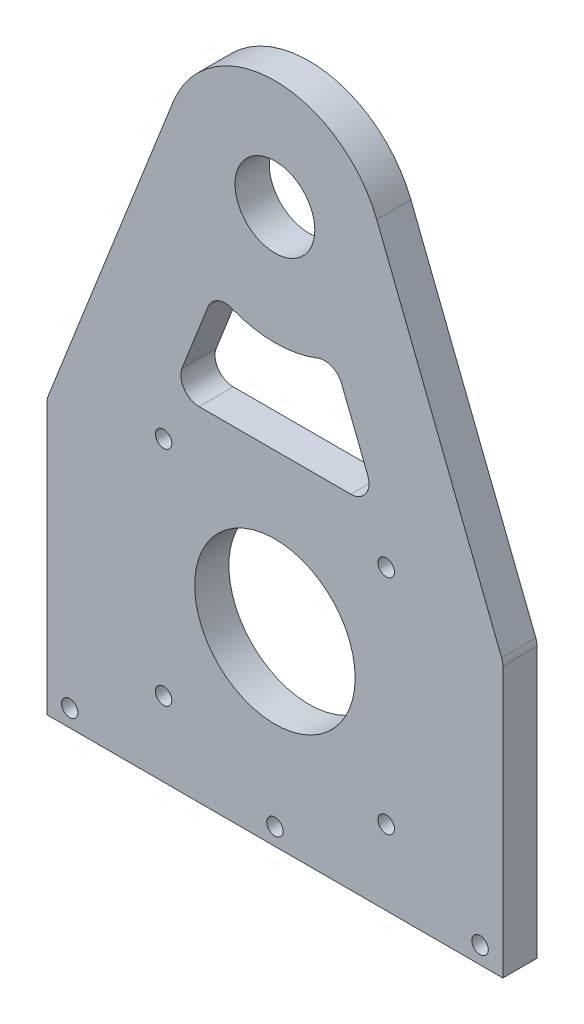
ISO-10303-21;
HEADER;
FILE_DESCRIPTION(('STEP AP214'),'2;1');
FILE_NAME('part.step','',(''),(''),'','','');
FILE_SCHEMA(('AUTOMOTIVE_DESIGN { 1 0 10303 214 1 1 1 1 }'));
ENDSEC;
DATA;
#1=APPLICATION_CONTEXT('core data for automotive mechanical design processes');
#2=APPLICATION_PROTOCOL_DEFINITION('international standard','automotive_design',2000,#1);
#3=PRODUCT_CONTEXT('',#1,'mechanical');
#4=PRODUCT('Part','Part','',(#3));
#5=PRODUCT_RELATED_PRODUCT_CATEGORY('part','',(#4));
#6=PRODUCT_DEFINITION_FORMATION('','',#4);
#7=PRODUCT_DEFINITION_CONTEXT('part definition',#1,'design');
#8=PRODUCT_DEFINITION('design','',#6,#7);
#9=PRODUCT_DEFINITION_SHAPE('','',#8);
#10=(LENGTH_UNIT() NAMED_UNIT(*) SI_UNIT(.MILLI.,.METRE.));
#11=(NAMED_UNIT(*) PLANE_ANGLE_UNIT() SI_UNIT($,.RADIAN.));
#12=(NAMED_UNIT(*) SI_UNIT($,.STERADIAN.) SOLID_ANGLE_UNIT());
#13=UNCERTAINTY_MEASURE_WITH_UNIT(LENGTH_MEASURE(1.E-05),#10,'distance_accuracy_value','');
#14=(GEOMETRIC_REPRESENTATION_CONTEXT(3) GLOBAL_UNCERTAINTY_ASSIGNED_CONTEXT((#13)) GLOBAL_UNIT_ASSIGNED_CONTEXT((#10,
#11,#12)) REPRESENTATION_CONTEXT('',''));
#15=CARTESIAN_POINT('',(0.,0.,0.));
#16=DIRECTION('',(0.,0.,1.));
#17=DIRECTION('',(1.,0.,0.));
#18=AXIS2_PLACEMENT_3D('',#15,#16,#17);
#19=CARTESIAN_POINT('',(-31.75,0.,4.7625));
#20=DIRECTION('',(1.,0.,0.));
#21=DIRECTION('',(0.,0.,-1.));
#22=AXIS2_PLACEMENT_3D('',#19,#20,#21);
#23=PLANE('',#22);
#24=DIRECTION('',(0.,-1.,0.));
#25=VECTOR('',#24,1.);
#26=CARTESIAN_POINT('',(-31.75,0.,4.7625));
#27=LINE('',#26,#25);
#28=CARTESIAN_POINT('',(-31.75,37.6177384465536,4.7625));
#29=VERTEX_POINT('',#28);
#30=CARTESIAN_POINT('',(-31.75,0.,4.7625));
#31=VERTEX_POINT('',#30);
#32=EDGE_CURVE('E142',#29,#31,#27,.T.);
#33=ORIENTED_EDGE('',*,*,#32,.F.);
#34=DIRECTION('',(0.,0.,-1.));
#35=VECTOR('',#34,1.);
#36=CARTESIAN_POINT('',(-31.75,37.6177384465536,4.7625));
#37=LINE('',#36,#35);
#38=CARTESIAN_POINT('',(-31.75,37.6177384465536,0.));
#39=VERTEX_POINT('',#38);
#40=EDGE_CURVE('E198',#29,#39,#37,.T.);
#41=ORIENTED_EDGE('',*,*,#40,.T.);
#42=DIRECTION('',(0.,-1.,0.));
#43=VECTOR('',#42,1.);
#44=CARTESIAN_POINT('',(-31.75,0.,0.));
#45=LINE('',#44,#43);
#46=CARTESIAN_POINT('',(-31.75,0.,0.));
#47=VERTEX_POINT('',#46);
#48=EDGE_CURVE('E164',#39,#47,#45,.T.);
#49=ORIENTED_EDGE('',*,*,#48,.T.);
#50=DIRECTION('',(0.,0.,-1.));
#51=VECTOR('',#50,1.);
#52=CARTESIAN_POINT('',(-31.75,0.,4.7625));
#53=LINE('',#52,#51);
#54=EDGE_CURVE('E157',#31,#47,#53,.T.);
#55=ORIENTED_EDGE('',*,*,#54,.F.);
#56=EDGE_LOOP('',(#33,#41,#49,#55));
#57=FACE_BOUND('',#56,.T.);
#58=ADVANCED_FACE('F31',(#57),#23,.F.);
#59=CARTESIAN_POINT('',(-31.75,0.,4.7625));
#60=DIRECTION('',(0.,1.,0.));
#61=DIRECTION('',(0.,0.,1.));
#62=AXIS2_PLACEMENT_3D('',#59,#60,#61);
#63=PLANE('',#62);
#64=DIRECTION('',(1.,0.,0.));
#65=VECTOR('',#64,1.);
#66=CARTESIAN_POINT('',(-31.75,0.,0.));
#67=LINE('',#66,#65);
#68=CARTESIAN_POINT('',(31.75,0.,0.));
#69=VERTEX_POINT('',#68);
#70=EDGE_CURVE('E324',#47,#69,#67,.T.);
#71=ORIENTED_EDGE('',*,*,#70,.T.);
#72=DIRECTION('',(0.,0.,-1.));
#73=VECTOR('',#72,1.);
#74=CARTESIAN_POINT('',(31.75,0.,4.7625));
#75=LINE('',#74,#73);
#76=CARTESIAN_POINT('',(31.75,0.,4.7625));
#77=VERTEX_POINT('',#76);
#78=EDGE_CURVE('E159',#77,#69,#75,.T.);
#79=ORIENTED_EDGE('',*,*,#78,.F.);
#80=DIRECTION('',(1.,0.,0.));
#81=VECTOR('',#80,1.);
#82=CARTESIAN_POINT('',(-31.75,0.,4.7625));
#83=LINE('',#82,#81);
#84=EDGE_CURVE('E146',#31,#77,#83,.T.);
#85=ORIENTED_EDGE('',*,*,#84,.F.);
#86=ORIENTED_EDGE('',*,*,#54,.T.);
#87=EDGE_LOOP('',(#71,#79,#85,#86));
#88=FACE_BOUND('',#87,.T.);
#89=ADVANCED_FACE('F156',(#88),#63,.F.);
#90=CARTESIAN_POINT('',(31.75,0.,4.7625));
#91=DIRECTION('',(-1.,0.,0.));
#92=DIRECTION('',(0.,0.,1.));
#93=AXIS2_PLACEMENT_3D('',#90,#91,#92);
#94=PLANE('',#93);
#95=DIRECTION('',(0.,1.,0.));
#96=VECTOR('',#95,1.);
#97=CARTESIAN_POINT('',(31.75,0.,0.));
#98=LINE('',#97,#96);
#99=CARTESIAN_POINT('',(31.75,37.6177384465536,0.));
#100=VERTEX_POINT('',#99);
#101=EDGE_CURVE('E326',#69,#100,#98,.T.);
#102=ORIENTED_EDGE('',*,*,#101,.T.);
#103=DIRECTION('',(0.,0.,-1.));
#104=VECTOR('',#103,1.);
#105=CARTESIAN_POINT('',(31.75,37.6177384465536,4.7625));
#106=LINE('',#105,#104);
#107=CARTESIAN_POINT('',(31.75,37.6177384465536,4.7625));
#108=VERTEX_POINT('',#107);
#109=EDGE_CURVE('E193',#100,#108,#106,.F.);
#110=ORIENTED_EDGE('',*,*,#109,.T.);
#111=DIRECTION('',(0.,1.,0.));
#112=VECTOR('',#111,1.);
#113=CARTESIAN_POINT('',(31.75,0.,4.7625));
#114=LINE('',#113,#112);
#115=EDGE_CURVE('E161',#77,#108,#114,.T.);
#116=ORIENTED_EDGE('',*,*,#115,.F.);
#117=ORIENTED_EDGE('',*,*,#78,.T.);
#118=EDGE_LOOP('',(#102,#110,#116,#117));
#119=FACE_BOUND('',#118,.T.);
#120=ADVANCED_FACE('F352',(#119),#94,.F.);
#121=CARTESIAN_POINT('',(31.75,38.1,4.7625));
#122=DIRECTION('',(-0.930409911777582,-0.366520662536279,0.));
#123=DIRECTION('',(0.366520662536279,-0.930409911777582,0.));
#124=AXIS2_PLACEMENT_3D('',#121,#122,#123);
#125=PLANE('',#124);
#126=DIRECTION('',(-0.366520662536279,0.930409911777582,0.));
#127=VECTOR('',#126,1.);
#128=CARTESIAN_POINT('',(31.75,38.1,4.7625));
#129=LINE('',#128,#127);
#130=CARTESIAN_POINT('',(31.5732411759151,38.5487009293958,4.7625));
#131=VERTEX_POINT('',#130);
#132=CARTESIAN_POINT('',(14.1794470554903,82.7027148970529,4.7625));
#133=VERTEX_POINT('',#132);
#134=EDGE_CURVE('E316',#131,#133,#129,.T.);
#135=ORIENTED_EDGE('',*,*,#134,.F.);
#136=DIRECTION('',(0.,0.,-1.));
#137=VECTOR('',#136,1.);
#138=CARTESIAN_POINT('',(31.5732411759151,38.5487009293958,4.7625));
#139=LINE('',#138,#137);
#140=CARTESIAN_POINT('',(31.5732411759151,38.5487009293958,0.));
#141=VERTEX_POINT('',#140);
#142=EDGE_CURVE('E186',#131,#141,#139,.T.);
#143=ORIENTED_EDGE('',*,*,#142,.T.);
#144=DIRECTION('',(-0.366520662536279,0.930409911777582,0.));
#145=VECTOR('',#144,1.);
#146=CARTESIAN_POINT('',(31.75,38.1,0.));
#147=LINE('',#146,#145);
#148=CARTESIAN_POINT('',(14.1794470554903,82.7027148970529,0.));
#149=VERTEX_POINT('',#148);
#150=EDGE_CURVE('E329',#141,#149,#147,.T.);
#151=ORIENTED_EDGE('',*,*,#150,.T.);
#152=DIRECTION('',(0.,0.,-1.));
#153=VECTOR('',#152,1.);
#154=CARTESIAN_POINT('',(14.1794470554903,82.7027148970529,4.7625));
#155=LINE('',#154,#153);
#156=EDGE_CURVE('E170',#133,#149,#155,.T.);
#157=ORIENTED_EDGE('',*,*,#156,.F.);
#158=EDGE_LOOP('',(#135,#143,#151,#157));
#159=FACE_BOUND('',#158,.T.);
#160=ADVANCED_FACE('F358',(#159),#125,.F.);
#161=CARTESIAN_POINT('',(0.,77.11694,4.7625));
#162=DIRECTION('',(0.,0.,-1.));
#163=DIRECTION('',(-1.,0.,0.));
#164=AXIS2_PLACEMENT_3D('',#161,#162,#163);
#165=CYLINDRICAL_SURFACE('',#164,15.24);
#166=CARTESIAN_POINT('',(0.,77.11694,0.));
#167=DIRECTION('',(0.,0.,1.));
#168=DIRECTION('',(-1.,0.,0.));
#169=AXIS2_PLACEMENT_3D('',#166,#167,#168);
#170=CIRCLE('',#169,15.24);
#171=CARTESIAN_POINT('',(-14.1794470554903,82.7027148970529,0.));
#172=VERTEX_POINT('',#171);
#173=EDGE_CURVE('E331',#149,#172,#170,.T.);
#174=ORIENTED_EDGE('',*,*,#173,.T.);
#175=DIRECTION('',(0.,0.,-1.));
#176=VECTOR('',#175,1.);
#177=CARTESIAN_POINT('',(-14.1794470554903,82.7027148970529,4.7625));
#178=LINE('',#177,#176);
#179=CARTESIAN_POINT('',(-14.1794470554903,82.7027148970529,4.7625));
#180=VERTEX_POINT('',#179);
#181=EDGE_CURVE('E322',#180,#172,#178,.T.);
#182=ORIENTED_EDGE('',*,*,#181,.F.);
#183=CARTESIAN_POINT('',(0.,77.11694,4.7625));
#184=DIRECTION('',(0.,0.,1.));
#185=DIRECTION('',(-1.,0.,0.));
#186=AXIS2_PLACEMENT_3D('',#183,#184,#185);
#187=CIRCLE('',#186,15.24);
#188=EDGE_CURVE('E318',#133,#180,#187,.T.);
#189=ORIENTED_EDGE('',*,*,#188,.F.);
#190=ORIENTED_EDGE('',*,*,#156,.T.);
#191=EDGE_LOOP('',(#174,#182,#189,#190));
#192=FACE_BOUND('',#191,.T.);
#193=ADVANCED_FACE('F340',(#192),#165,.T.);
#194=CARTESIAN_POINT('',(-31.75,38.1,4.7625));
#195=DIRECTION('',(0.930409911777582,-0.366520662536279,0.));
#196=DIRECTION('',(0.366520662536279,0.930409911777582,0.));
#197=AXIS2_PLACEMENT_3D('',#194,#195,#196);
#198=PLANE('',#197);
#199=DIRECTION('',(-0.366520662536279,-0.930409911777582,0.));
#200=VECTOR('',#199,1.);
#201=CARTESIAN_POINT('',(-31.75,38.1,0.));
#202=LINE('',#201,#200);
#203=CARTESIAN_POINT('',(-31.5732411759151,38.5487009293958,0.));
#204=VERTEX_POINT('',#203);
#205=EDGE_CURVE('E152',#172,#204,#202,.T.);
#206=ORIENTED_EDGE('',*,*,#205,.T.);
#207=DIRECTION('',(0.,0.,-1.));
#208=VECTOR('',#207,1.);
#209=CARTESIAN_POINT('',(-31.5732411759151,38.5487009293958,4.7625));
#210=LINE('',#209,#208);
#211=CARTESIAN_POINT('',(-31.5732411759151,38.5487009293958,4.7625));
#212=VERTEX_POINT('',#211);
#213=EDGE_CURVE('E46',#204,#212,#210,.F.);
#214=ORIENTED_EDGE('',*,*,#213,.T.);
#215=DIRECTION('',(-0.366520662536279,-0.930409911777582,0.));
#216=VECTOR('',#215,1.);
#217=CARTESIAN_POINT('',(-31.75,38.1,4.7625));
#218=LINE('',#217,#216);
#219=EDGE_CURVE('E320',#180,#212,#218,.T.);
#220=ORIENTED_EDGE('',*,*,#219,.F.);
#221=ORIENTED_EDGE('',*,*,#181,.T.);
#222=EDGE_LOOP('',(#206,#214,#220,#221));
#223=FACE_BOUND('',#222,.T.);
#224=ADVANCED_FACE('F347',(#223),#198,.F.);
#225=CARTESIAN_POINT('',(0.,77.11694,4.7625));
#226=DIRECTION('',(0.,0.,-1.));
#227=DIRECTION('',(-1.,0.,0.));
#228=AXIS2_PLACEMENT_3D('',#225,#226,#227);
#229=PLANE('',#228);
#230=DIRECTION('',(-0.366520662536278,-0.930409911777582,0.));
#231=VECTOR('',#230,1.);
#232=CARTESIAN_POINT('',(-8.29106324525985,63.0001712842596,4.7625));
#233=LINE('',#232,#231);
#234=CARTESIAN_POINT('',(-9.29468410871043,60.4524873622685,4.7625));
#235=VERTEX_POINT('',#234);
#236=CARTESIAN_POINT('',(-12.9261485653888,51.2340424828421,4.7625));
#237=VERTEX_POINT('',#236);
#238=EDGE_CURVE('E222',#235,#237,#233,.T.);
#239=ORIENTED_EDGE('',*,*,#238,.F.);
#240=CARTESIAN_POINT('',(-6.93144293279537,59.5215248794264,4.7625));
#241=DIRECTION('',(0.,0.,-1.));
#242=DIRECTION('',(-1.,0.,0.));
#243=AXIS2_PLACEMENT_3D('',#240,#241,#242);
#244=CIRCLE('',#243,2.54);
#245=CARTESIAN_POINT('',(-6.00048044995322,61.8847660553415,4.7625));
#246=VERTEX_POINT('',#245);
#247=EDGE_CURVE('E210',#235,#246,#244,.T.);
#248=ORIENTED_EDGE('',*,*,#247,.T.);
#249=CARTESIAN_POINT('',(0.,77.11694,4.7625));
#250=DIRECTION('',(0.,0.,-1.));
#251=DIRECTION('',(1.,0.,0.));
#252=AXIS2_PLACEMENT_3D('',#249,#250,#251);
#253=CIRCLE('',#252,16.3714656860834);
#254=CARTESIAN_POINT('',(6.00048044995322,61.8847660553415,4.7625));
#255=VERTEX_POINT('',#254);
#256=EDGE_CURVE('E233',#255,#246,#253,.T.);
#257=ORIENTED_EDGE('',*,*,#256,.F.);
#258=CARTESIAN_POINT('',(6.93144293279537,59.5215248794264,4.7625));
#259=DIRECTION('',(0.,0.,-1.));
#260=DIRECTION('',(-1.,0.,0.));
#261=AXIS2_PLACEMENT_3D('',#258,#259,#260);
#262=CIRCLE('',#261,2.54);
#263=CARTESIAN_POINT('',(9.29468410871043,60.4524873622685,4.7625));
#264=VERTEX_POINT('',#263);
#265=EDGE_CURVE('E206',#255,#264,#262,.T.);
#266=ORIENTED_EDGE('',*,*,#265,.T.);
#267=DIRECTION('',(-0.366520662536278,0.930409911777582,0.));
#268=VECTOR('',#267,1.);
#269=CARTESIAN_POINT('',(14.2934808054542,47.76308,4.7625));
#270=LINE('',#269,#268);
#271=CARTESIAN_POINT('',(12.9261485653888,51.2340424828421,4.7625));
#272=VERTEX_POINT('',#271);
#273=EDGE_CURVE('E259',#272,#264,#270,.T.);
#274=ORIENTED_EDGE('',*,*,#273,.F.);
#275=CARTESIAN_POINT('',(10.5629073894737,50.30308,4.7625));
#276=DIRECTION('',(0.,0.,-1.));
#277=DIRECTION('',(-1.,0.,0.));
#278=AXIS2_PLACEMENT_3D('',#275,#276,#277);
#279=CIRCLE('',#278,2.54);
#280=CARTESIAN_POINT('',(10.5629073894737,47.76308,4.7625));
#281=VERTEX_POINT('',#280);
#282=EDGE_CURVE('E214',#272,#281,#279,.T.);
#283=ORIENTED_EDGE('',*,*,#282,.T.);
#284=DIRECTION('',(1.,0.,0.));
#285=VECTOR('',#284,1.);
#286=CARTESIAN_POINT('',(-14.2934808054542,47.76308,4.7625));
#287=LINE('',#286,#285);
#288=CARTESIAN_POINT('',(-10.5629073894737,47.76308,4.7625));
#289=VERTEX_POINT('',#288);
#290=EDGE_CURVE('E224',#289,#281,#287,.T.);
#291=ORIENTED_EDGE('',*,*,#290,.F.);
#292=CARTESIAN_POINT('',(-10.5629073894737,50.30308,4.7625));
#293=DIRECTION('',(0.,0.,-1.));
#294=DIRECTION('',(-1.,0.,0.));
#295=AXIS2_PLACEMENT_3D('',#292,#293,#294);
#296=CIRCLE('',#295,2.54);
#297=EDGE_CURVE('E39',#289,#237,#296,.T.);
#298=ORIENTED_EDGE('',*,*,#297,.T.);
#299=EDGE_LOOP('',(#239,#248,#257,#266,#274,#283,#291,#298));
#300=FACE_BOUND('',#299,.T.);
#301=CARTESIAN_POINT('',(0.,77.11694,4.7625));
#302=DIRECTION('',(0.,0.,1.));
#303=DIRECTION('',(1.,0.,0.));
#304=AXIS2_PLACEMENT_3D('',#301,#302,#303);
#305=CIRCLE('',#304,5.55625);
#306=CARTESIAN_POINT('',(5.55625,77.11694,4.7625));
#307=VERTEX_POINT('',#306);
#308=EDGE_CURVE('E250',#307,#307,#305,.T.);
#309=ORIENTED_EDGE('',*,*,#308,.F.);
#310=EDGE_LOOP('',(#309));
#311=FACE_BOUND('',#310,.T.);
#312=CARTESIAN_POINT('',(-15.5,10.41308,4.7625));
#313=DIRECTION('',(0.,0.,1.));
#314=DIRECTION('',(1.,0.,0.));
#315=AXIS2_PLACEMENT_3D('',#312,#313,#314);
#316=CIRCLE('',#315,1.143);
#317=CARTESIAN_POINT('',(-14.357,10.41308,4.7625));
#318=VERTEX_POINT('',#317);
#319=EDGE_CURVE('E265',#318,#318,#316,.T.);
#320=ORIENTED_EDGE('',*,*,#319,.F.);
#321=EDGE_LOOP('',(#320));
#322=FACE_BOUND('',#321,.T.);
#323=CARTESIAN_POINT('',(15.5,10.41308,4.7625));
#324=DIRECTION('',(0.,0.,1.));
#325=DIRECTION('',(1.,0.,0.));
#326=AXIS2_PLACEMENT_3D('',#323,#324,#325);
#327=CIRCLE('',#326,1.143);
#328=CARTESIAN_POINT('',(16.643,10.41308,4.7625));
#329=VERTEX_POINT('',#328);
#330=EDGE_CURVE('E271',#329,#329,#327,.T.);
#331=ORIENTED_EDGE('',*,*,#330,.F.);
#332=EDGE_LOOP('',(#331));
#333=FACE_BOUND('',#332,.T.);
#334=CARTESIAN_POINT('',(15.5,41.41308,4.7625));
#335=DIRECTION('',(0.,0.,1.));
#336=DIRECTION('',(1.,0.,0.));
#337=AXIS2_PLACEMENT_3D('',#334,#335,#336);
#338=CIRCLE('',#337,1.143);
#339=CARTESIAN_POINT('',(16.643,41.41308,4.7625));
#340=VERTEX_POINT('',#339);
#341=EDGE_CURVE('E277',#340,#340,#338,.T.);
#342=ORIENTED_EDGE('',*,*,#341,.F.);
#343=EDGE_LOOP('',(#342));
#344=FACE_BOUND('',#343,.T.);
#345=CARTESIAN_POINT('',(-15.5,41.41308,4.7625));
#346=DIRECTION('',(0.,0.,1.));
#347=DIRECTION('',(1.,0.,0.));
#348=AXIS2_PLACEMENT_3D('',#345,#346,#347);
#349=CIRCLE('',#348,1.143);
#350=CARTESIAN_POINT('',(-14.357,41.41308,4.7625));
#351=VERTEX_POINT('',#350);
#352=EDGE_CURVE('E283',#351,#351,#349,.T.);
#353=ORIENTED_EDGE('',*,*,#352,.F.);
#354=EDGE_LOOP('',(#353));
#355=FACE_BOUND('',#354,.T.);
#356=CARTESIAN_POINT('',(0.,25.91308,4.7625));
#357=DIRECTION('',(0.,0.,1.));
#358=DIRECTION('',(1.,0.,0.));
#359=AXIS2_PLACEMENT_3D('',#356,#357,#358);
#360=CIRCLE('',#359,11.176);
#361=CARTESIAN_POINT('',(11.176,25.91308,4.7625));
#362=VERTEX_POINT('',#361);
#363=EDGE_CURVE('E289',#362,#362,#360,.T.);
#364=ORIENTED_EDGE('',*,*,#363,.F.);
#365=EDGE_LOOP('',(#364));
#366=FACE_BOUND('',#365,.T.);
#367=CARTESIAN_POINT('',(0.,2.38125,4.7625));
#368=DIRECTION('',(0.,0.,1.));
#369=DIRECTION('',(1.,0.,0.));
#370=AXIS2_PLACEMENT_3D('',#367,#368,#369);
#371=CIRCLE('',#370,1.143);
#372=CARTESIAN_POINT('',(1.14300000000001,2.38125,4.7625));
#373=VERTEX_POINT('',#372);
#374=EDGE_CURVE('E295',#373,#373,#371,.T.);
#375=ORIENTED_EDGE('',*,*,#374,.F.);
#376=EDGE_LOOP('',(#375));
#377=FACE_BOUND('',#376,.T.);
#378=CARTESIAN_POINT('',(28.575,2.38125,4.7625));
#379=DIRECTION('',(0.,0.,1.));
#380=DIRECTION('',(-1.,0.,0.));
#381=AXIS2_PLACEMENT_3D('',#378,#379,#380);
#382=CIRCLE('',#381,1.143);
#383=CARTESIAN_POINT('',(29.718,2.38125,4.7625));
#384=VERTEX_POINT('',#383);
#385=EDGE_CURVE('E301',#384,#384,#382,.T.);
#386=ORIENTED_EDGE('',*,*,#385,.F.);
#387=EDGE_LOOP('',(#386));
#388=FACE_BOUND('',#387,.T.);
#389=CARTESIAN_POINT('',(-28.575,2.38125,4.7625));
#390=DIRECTION('',(0.,0.,1.));
#391=DIRECTION('',(1.,0.,0.));
#392=AXIS2_PLACEMENT_3D('',#389,#390,#391);
#393=CIRCLE('',#392,1.143);
#394=CARTESIAN_POINT('',(-27.432,2.38125,4.7625));
#395=VERTEX_POINT('',#394);
#396=EDGE_CURVE('E307',#395,#395,#393,.T.);
#397=ORIENTED_EDGE('',*,*,#396,.F.);
#398=EDGE_LOOP('',(#397));
#399=FACE_BOUND('',#398,.T.);
#400=ORIENTED_EDGE('',*,*,#115,.T.);
#401=CARTESIAN_POINT('',(29.21,37.6177384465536,4.7625));
#402=DIRECTION('',(0.,0.,-1.));
#403=DIRECTION('',(-1.,0.,0.));
#404=AXIS2_PLACEMENT_3D('',#401,#402,#403);
#405=CIRCLE('',#404,2.54);
#406=EDGE_CURVE('E196',#108,#131,#405,.F.);
#407=ORIENTED_EDGE('',*,*,#406,.T.);
#408=ORIENTED_EDGE('',*,*,#134,.T.);
#409=ORIENTED_EDGE('',*,*,#188,.T.);
#410=ORIENTED_EDGE('',*,*,#219,.T.);
#411=CARTESIAN_POINT('',(-29.21,37.6177384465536,4.7625));
#412=DIRECTION('',(0.,0.,-1.));
#413=DIRECTION('',(-1.,0.,0.));
#414=AXIS2_PLACEMENT_3D('',#411,#412,#413);
#415=CIRCLE('',#414,2.54);
#416=EDGE_CURVE('E53',#212,#29,#415,.F.);
#417=ORIENTED_EDGE('',*,*,#416,.T.);
#418=ORIENTED_EDGE('',*,*,#32,.T.);
#419=ORIENTED_EDGE('',*,*,#84,.T.);
#420=EDGE_LOOP('',(#400,#407,#408,#409,#410,#417,#418,#419));
#421=FACE_BOUND('',#420,.T.);
#422=ADVANCED_FACE('F145',(#300,#311,#322,#333,#344,#355,#366,#377,#388,#399,#421),#229,.F.);
#423=CARTESIAN_POINT('',(0.,77.11694,0.));
#424=DIRECTION('',(0.,0.,-1.));
#425=DIRECTION('',(-1.,0.,0.));
#426=AXIS2_PLACEMENT_3D('',#423,#424,#425);
#427=PLANE('',#426);
#428=DIRECTION('',(-0.366520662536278,0.930409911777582,0.));
#429=VECTOR('',#428,1.);
#430=CARTESIAN_POINT('',(14.2934808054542,47.76308,0.));
#431=LINE('',#430,#429);
#432=CARTESIAN_POINT('',(12.9261485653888,51.2340424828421,0.));
#433=VERTEX_POINT('',#432);
#434=CARTESIAN_POINT('',(9.29468410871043,60.4524873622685,0.));
#435=VERTEX_POINT('',#434);
#436=EDGE_CURVE('E248',#433,#435,#431,.T.);
#437=ORIENTED_EDGE('',*,*,#436,.T.);
#438=CARTESIAN_POINT('',(6.93144293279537,59.5215248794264,0.));
#439=DIRECTION('',(0.,0.,-1.));
#440=DIRECTION('',(-1.,0.,0.));
#441=AXIS2_PLACEMENT_3D('',#438,#439,#440);
#442=CIRCLE('',#441,2.54);
#443=CARTESIAN_POINT('',(6.00048044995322,61.8847660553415,0.));
#444=VERTEX_POINT('',#443);
#445=EDGE_CURVE('E208',#435,#444,#442,.F.);
#446=ORIENTED_EDGE('',*,*,#445,.T.);
#447=CARTESIAN_POINT('',(0.,77.11694,0.));
#448=DIRECTION('',(0.,0.,-1.));
#449=DIRECTION('',(1.,0.,0.));
#450=AXIS2_PLACEMENT_3D('',#447,#448,#449);
#451=CIRCLE('',#450,16.3714656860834);
#452=CARTESIAN_POINT('',(-6.00048044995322,61.8847660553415,0.));
#453=VERTEX_POINT('',#452);
#454=EDGE_CURVE('E252',#444,#453,#451,.T.);
#455=ORIENTED_EDGE('',*,*,#454,.T.);
#456=CARTESIAN_POINT('',(-6.93144293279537,59.5215248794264,0.));
#457=DIRECTION('',(0.,0.,-1.));
#458=DIRECTION('',(-1.,0.,0.));
#459=AXIS2_PLACEMENT_3D('',#456,#457,#458);
#460=CIRCLE('',#459,2.54);
#461=CARTESIAN_POINT('',(-9.29468410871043,60.4524873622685,0.));
#462=VERTEX_POINT('',#461);
#463=EDGE_CURVE('E212',#453,#462,#460,.F.);
#464=ORIENTED_EDGE('',*,*,#463,.T.);
#465=DIRECTION('',(-0.366520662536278,-0.930409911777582,0.));
#466=VECTOR('',#465,1.);
#467=CARTESIAN_POINT('',(-8.29106324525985,63.0001712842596,0.));
#468=LINE('',#467,#466);
#469=CARTESIAN_POINT('',(-12.9261485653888,51.2340424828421,0.));
#470=VERTEX_POINT('',#469);
#471=EDGE_CURVE('E244',#462,#470,#468,.T.);
#472=ORIENTED_EDGE('',*,*,#471,.T.);
#473=CARTESIAN_POINT('',(-10.5629073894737,50.30308,0.));
#474=DIRECTION('',(0.,0.,-1.));
#475=DIRECTION('',(-1.,0.,0.));
#476=AXIS2_PLACEMENT_3D('',#473,#474,#475);
#477=CIRCLE('',#476,2.54);
#478=CARTESIAN_POINT('',(-10.5629073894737,47.76308,0.));
#479=VERTEX_POINT('',#478);
#480=EDGE_CURVE('E11',#470,#479,#477,.F.);
#481=ORIENTED_EDGE('',*,*,#480,.T.);
#482=DIRECTION('',(1.,0.,0.));
#483=VECTOR('',#482,1.);
#484=CARTESIAN_POINT('',(-14.2934808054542,47.76308,0.));
#485=LINE('',#484,#483);
#486=CARTESIAN_POINT('',(10.5629073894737,47.76308,0.));
#487=VERTEX_POINT('',#486);
#488=EDGE_CURVE('E242',#479,#487,#485,.T.);
#489=ORIENTED_EDGE('',*,*,#488,.T.);
#490=CARTESIAN_POINT('',(10.5629073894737,50.30308,0.));
#491=DIRECTION('',(0.,0.,-1.));
#492=DIRECTION('',(-1.,0.,0.));
#493=AXIS2_PLACEMENT_3D('',#490,#491,#492);
#494=CIRCLE('',#493,2.54);
#495=EDGE_CURVE('E216',#487,#433,#494,.F.);
#496=ORIENTED_EDGE('',*,*,#495,.T.);
#497=EDGE_LOOP('',(#437,#446,#455,#464,#472,#481,#489,#496));
#498=FACE_BOUND('',#497,.T.);
#499=CARTESIAN_POINT('',(0.,77.11694,0.));
#500=DIRECTION('',(0.,0.,1.));
#501=DIRECTION('',(1.,0.,0.));
#502=AXIS2_PLACEMENT_3D('',#499,#500,#501);
#503=CIRCLE('',#502,5.55625);
#504=CARTESIAN_POINT('',(5.55625,77.11694,0.));
#505=VERTEX_POINT('',#504);
#506=EDGE_CURVE('E262',#505,#505,#503,.T.);
#507=ORIENTED_EDGE('',*,*,#506,.T.);
#508=EDGE_LOOP('',(#507));
#509=FACE_BOUND('',#508,.T.);
#510=CARTESIAN_POINT('',(-15.5,10.41308,0.));
#511=DIRECTION('',(0.,0.,1.));
#512=DIRECTION('',(1.,0.,0.));
#513=AXIS2_PLACEMENT_3D('',#510,#511,#512);
#514=CIRCLE('',#513,1.143);
#515=CARTESIAN_POINT('',(-14.357,10.41308,0.));
#516=VERTEX_POINT('',#515);
#517=EDGE_CURVE('E268',#516,#516,#514,.T.);
#518=ORIENTED_EDGE('',*,*,#517,.T.);
#519=EDGE_LOOP('',(#518));
#520=FACE_BOUND('',#519,.T.);
#521=CARTESIAN_POINT('',(15.5,10.41308,0.));
#522=DIRECTION('',(0.,0.,1.));
#523=DIRECTION('',(1.,0.,0.));
#524=AXIS2_PLACEMENT_3D('',#521,#522,#523);
#525=CIRCLE('',#524,1.143);
#526=CARTESIAN_POINT('',(16.643,10.41308,0.));
#527=VERTEX_POINT('',#526);
#528=EDGE_CURVE('E274',#527,#527,#525,.T.);
#529=ORIENTED_EDGE('',*,*,#528,.T.);
#530=EDGE_LOOP('',(#529));
#531=FACE_BOUND('',#530,.T.);
#532=CARTESIAN_POINT('',(15.5,41.41308,0.));
#533=DIRECTION('',(0.,0.,1.));
#534=DIRECTION('',(1.,0.,0.));
#535=AXIS2_PLACEMENT_3D('',#532,#533,#534);
#536=CIRCLE('',#535,1.143);
#537=CARTESIAN_POINT('',(16.643,41.41308,0.));
#538=VERTEX_POINT('',#537);
#539=EDGE_CURVE('E280',#538,#538,#536,.T.);
#540=ORIENTED_EDGE('',*,*,#539,.T.);
#541=EDGE_LOOP('',(#540));
#542=FACE_BOUND('',#541,.T.);
#543=CARTESIAN_POINT('',(-15.5,41.41308,0.));
#544=DIRECTION('',(0.,0.,1.));
#545=DIRECTION('',(1.,0.,0.));
#546=AXIS2_PLACEMENT_3D('',#543,#544,#545);
#547=CIRCLE('',#546,1.143);
#548=CARTESIAN_POINT('',(-14.357,41.41308,0.));
#549=VERTEX_POINT('',#548);
#550=EDGE_CURVE('E286',#549,#549,#547,.T.);
#551=ORIENTED_EDGE('',*,*,#550,.T.);
#552=EDGE_LOOP('',(#551));
#553=FACE_BOUND('',#552,.T.);
#554=CARTESIAN_POINT('',(0.,25.91308,0.));
#555=DIRECTION('',(0.,0.,1.));
#556=DIRECTION('',(1.,0.,0.));
#557=AXIS2_PLACEMENT_3D('',#554,#555,#556);
#558=CIRCLE('',#557,11.176);
#559=CARTESIAN_POINT('',(11.176,25.91308,0.));
#560=VERTEX_POINT('',#559);
#561=EDGE_CURVE('E292',#560,#560,#558,.T.);
#562=ORIENTED_EDGE('',*,*,#561,.T.);
#563=EDGE_LOOP('',(#562));
#564=FACE_BOUND('',#563,.T.);
#565=CARTESIAN_POINT('',(0.,2.38125,0.));
#566=DIRECTION('',(0.,0.,1.));
#567=DIRECTION('',(1.,0.,0.));
#568=AXIS2_PLACEMENT_3D('',#565,#566,#567);
#569=CIRCLE('',#568,1.143);
#570=CARTESIAN_POINT('',(1.14300000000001,2.38125,0.));
#571=VERTEX_POINT('',#570);
#572=EDGE_CURVE('E298',#571,#571,#569,.T.);
#573=ORIENTED_EDGE('',*,*,#572,.T.);
#574=EDGE_LOOP('',(#573));
#575=FACE_BOUND('',#574,.T.);
#576=CARTESIAN_POINT('',(28.575,2.38125,0.));
#577=DIRECTION('',(0.,0.,1.));
#578=DIRECTION('',(-1.,0.,0.));
#579=AXIS2_PLACEMENT_3D('',#576,#577,#578);
#580=CIRCLE('',#579,1.143);
#581=CARTESIAN_POINT('',(29.718,2.38125,0.));
#582=VERTEX_POINT('',#581);
#583=EDGE_CURVE('E304',#582,#582,#580,.T.);
#584=ORIENTED_EDGE('',*,*,#583,.T.);
#585=EDGE_LOOP('',(#584));
#586=FACE_BOUND('',#585,.T.);
#587=CARTESIAN_POINT('',(-28.575,2.38125,0.));
#588=DIRECTION('',(0.,0.,1.));
#589=DIRECTION('',(1.,0.,0.));
#590=AXIS2_PLACEMENT_3D('',#587,#588,#589);
#591=CIRCLE('',#590,1.143);
#592=CARTESIAN_POINT('',(-27.432,2.38125,0.));
#593=VERTEX_POINT('',#592);
#594=EDGE_CURVE('E310',#593,#593,#591,.T.);
#595=ORIENTED_EDGE('',*,*,#594,.T.);
#596=EDGE_LOOP('',(#595));
#597=FACE_BOUND('',#596,.T.);
#598=ORIENTED_EDGE('',*,*,#150,.F.);
#599=CARTESIAN_POINT('',(29.21,37.6177384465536,0.));
#600=DIRECTION('',(0.,0.,-1.));
#601=DIRECTION('',(-1.,0.,0.));
#602=AXIS2_PLACEMENT_3D('',#599,#600,#601);
#603=CIRCLE('',#602,2.54);
#604=EDGE_CURVE('E191',#141,#100,#603,.T.);
#605=ORIENTED_EDGE('',*,*,#604,.T.);
#606=ORIENTED_EDGE('',*,*,#101,.F.);
#607=ORIENTED_EDGE('',*,*,#70,.F.);
#608=ORIENTED_EDGE('',*,*,#48,.F.);
#609=CARTESIAN_POINT('',(-29.21,37.6177384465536,0.));
#610=DIRECTION('',(0.,0.,-1.));
#611=DIRECTION('',(-1.,0.,0.));
#612=AXIS2_PLACEMENT_3D('',#609,#610,#611);
#613=CIRCLE('',#612,2.54);
#614=EDGE_CURVE('E189',#39,#204,#613,.T.);
#615=ORIENTED_EDGE('',*,*,#614,.T.);
#616=ORIENTED_EDGE('',*,*,#205,.F.);
#617=ORIENTED_EDGE('',*,*,#173,.F.);
#618=EDGE_LOOP('',(#598,#605,#606,#607,#608,#615,#616,#617));
#619=FACE_BOUND('',#618,.T.);
#620=ADVANCED_FACE('F240',(#498,#509,#520,#531,#542,#553,#564,#575,#586,#597,#619),#427,.T.);
#621=CARTESIAN_POINT('',(-28.575,2.38125,0.));
#622=DIRECTION('',(0.,0.,1.));
#623=DIRECTION('',(1.,0.,0.));
#624=AXIS2_PLACEMENT_3D('',#621,#622,#623);
#625=CYLINDRICAL_SURFACE('',#624,1.143);
#626=CARTESIAN_POINT('',(-27.432,2.38125,0.));
#627=CARTESIAN_POINT('',(-27.432,2.38125,0.049609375));
#628=CARTESIAN_POINT('',(-27.432,2.38125,0.09921875));
#629=CARTESIAN_POINT('',(-27.432,2.38125,0.1984375));
#630=CARTESIAN_POINT('',(-27.432,2.38125,0.248046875));
#631=CARTESIAN_POINT('',(-27.432,2.38125,0.347265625));
#632=CARTESIAN_POINT('',(-27.432,2.38125,0.396875));
#633=CARTESIAN_POINT('',(-27.432,2.38125,0.49609375));
#634=CARTESIAN_POINT('',(-27.432,2.38125,0.545703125));
#635=CARTESIAN_POINT('',(-27.432,2.38125,0.644921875));
#636=CARTESIAN_POINT('',(-27.432,2.38125,0.69453125));
#637=CARTESIAN_POINT('',(-27.432,2.38125,0.79375));
#638=CARTESIAN_POINT('',(-27.432,2.38125,0.843359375));
#639=CARTESIAN_POINT('',(-27.432,2.38125,0.942578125));
#640=CARTESIAN_POINT('',(-27.432,2.38125,0.9921875));
#641=CARTESIAN_POINT('',(-27.432,2.38125,1.09140625));
#642=CARTESIAN_POINT('',(-27.432,2.38125,1.141015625));
#643=CARTESIAN_POINT('',(-27.432,2.38125,1.240234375));
#644=CARTESIAN_POINT('',(-27.432,2.38125,1.28984375));
#645=CARTESIAN_POINT('',(-27.432,2.38125,1.3890625));
#646=CARTESIAN_POINT('',(-27.432,2.38125,1.438671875));
#647=CARTESIAN_POINT('',(-27.432,2.38125,1.537890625));
#648=CARTESIAN_POINT('',(-27.432,2.38125,1.5875));
#649=CARTESIAN_POINT('',(-27.432,2.38125,1.68671875));
#650=CARTESIAN_POINT('',(-27.432,2.38125,1.736328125));
#651=CARTESIAN_POINT('',(-27.432,2.38125,1.835546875));
#652=CARTESIAN_POINT('',(-27.432,2.38125,1.88515625));
#653=CARTESIAN_POINT('',(-27.432,2.38125,1.984375));
#654=CARTESIAN_POINT('',(-27.432,2.38125,2.033984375));
#655=CARTESIAN_POINT('',(-27.432,2.38125,2.133203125));
#656=CARTESIAN_POINT('',(-27.432,2.38125,2.1828125));
#657=CARTESIAN_POINT('',(-27.432,2.38125,2.28203125));
#658=CARTESIAN_POINT('',(-27.432,2.38125,2.331640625));
#659=CARTESIAN_POINT('',(-27.432,2.38125,2.430859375));
#660=CARTESIAN_POINT('',(-27.432,2.38125,2.48046875));
#661=CARTESIAN_POINT('',(-27.432,2.38125,2.5796875));
#662=CARTESIAN_POINT('',(-27.432,2.38125,2.629296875));
#663=CARTESIAN_POINT('',(-27.432,2.38125,2.728515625));
#664=CARTESIAN_POINT('',(-27.432,2.38125,2.778125));
#665=CARTESIAN_POINT('',(-27.432,2.38125,2.87734375));
#666=CARTESIAN_POINT('',(-27.432,2.38125,2.926953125));
#667=CARTESIAN_POINT('',(-27.432,2.38125,3.026171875));
#668=CARTESIAN_POINT('',(-27.432,2.38125,3.07578125));
#669=CARTESIAN_POINT('',(-27.432,2.38125,3.175));
#670=CARTESIAN_POINT('',(-27.432,2.38125,3.224609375));
#671=CARTESIAN_POINT('',(-27.432,2.38125,3.323828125));
#672=CARTESIAN_POINT('',(-27.432,2.38125,3.3734375));
#673=CARTESIAN_POINT('',(-27.432,2.38125,3.47265625));
#674=CARTESIAN_POINT('',(-27.432,2.38125,3.522265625));
#675=CARTESIAN_POINT('',(-27.432,2.38125,3.621484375));
#676=CARTESIAN_POINT('',(-27.432,2.38125,3.67109375));
#677=CARTESIAN_POINT('',(-27.432,2.38125,3.7703125));
#678=CARTESIAN_POINT('',(-27.432,2.38125,3.819921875));
#679=CARTESIAN_POINT('',(-27.432,2.38125,3.919140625));
#680=CARTESIAN_POINT('',(-27.432,2.38125,3.96875));
#681=CARTESIAN_POINT('',(-27.432,2.38125,4.06796875));
#682=CARTESIAN_POINT('',(-27.432,2.38125,4.117578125));
#683=CARTESIAN_POINT('',(-27.432,2.38125,4.216796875));
#684=CARTESIAN_POINT('',(-27.432,2.38125,4.26640625));
#685=CARTESIAN_POINT('',(-27.432,2.38125,4.365625));
#686=CARTESIAN_POINT('',(-27.432,2.38125,4.415234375));
#687=CARTESIAN_POINT('',(-27.432,2.38125,4.514453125));
#688=CARTESIAN_POINT('',(-27.432,2.38125,4.5640625));
#689=CARTESIAN_POINT('',(-27.432,2.38125,4.66328125));
#690=CARTESIAN_POINT('',(-27.432,2.38125,4.712890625));
#691=CARTESIAN_POINT('',(-27.432,2.38125,4.7625));
#692=B_SPLINE_CURVE_WITH_KNOTS('',3,(#626,#627,#628,#629,#630,#631,#632,#633,#634,#635,#636,
#637,#638,#639,#640,#641,#642,#643,#644,#645,#646,#647,#648,#649,#650,#651,#652,#653,#654,#655,
#656,#657,#658,#659,#660,#661,#662,#663,#664,#665,#666,#667,#668,#669,#670,#671,#672,#673,#674,
#675,#676,#677,#678,#679,#680,#681,#682,#683,#684,#685,#686,#687,#688,#689,#690,#691),
.UNSPECIFIED.,.F.,.F.,(4,2,2,2,2,2,2,2,2,2,2,2,2,2,2,2,2,2,2,2,2,2,2,2,2,2,2,2,2,2,2,2,4),(0.,
0.148828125,0.29765625,0.446484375,0.5953125,0.744140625,0.89296875,1.041796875,1.190625,
1.339453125,1.48828125,1.637109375,1.7859375,1.934765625,2.08359375,2.232421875,2.38125,
2.530078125,2.67890625,2.827734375,2.9765625,3.125390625,3.27421875,3.423046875,3.571875,
3.720703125,3.86953125,4.018359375,4.1671875,4.316015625,4.46484375,4.613671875,4.7625),.UNSPECIFIED.);
#693=EDGE_CURVE('BSEAM446',#593,#395,#692,.T.);
#694=ORIENTED_EDGE('',*,*,#594,.F.);
#695=ORIENTED_EDGE('',*,*,#396,.T.);
#696=ORIENTED_EDGE('',*,*,#693,.T.);
#697=ORIENTED_EDGE('',*,*,#693,.F.);
#698=EDGE_LOOP('',(#694,#696,#695,#697));
#699=FACE_BOUND('',#698,.T.);
#700=ADVANCED_FACE('F446',(#699),#625,.F.);
#701=CARTESIAN_POINT('',(28.575,2.38125,0.));
#702=DIRECTION('',(0.,0.,1.));
#703=DIRECTION('',(1.,0.,0.));
#704=AXIS2_PLACEMENT_3D('',#701,#702,#703);
#705=CYLINDRICAL_SURFACE('',#704,1.143);
#706=CARTESIAN_POINT('',(29.718,2.38125,0.));
#707=CARTESIAN_POINT('',(29.718,2.38125,0.049609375));
#708=CARTESIAN_POINT('',(29.718,2.38125,0.09921875));
#709=CARTESIAN_POINT('',(29.718,2.38125,0.1984375));
#710=CARTESIAN_POINT('',(29.718,2.38125,0.248046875));
#711=CARTESIAN_POINT('',(29.718,2.38125,0.347265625));
#712=CARTESIAN_POINT('',(29.718,2.38125,0.396875));
#713=CARTESIAN_POINT('',(29.718,2.38125,0.49609375));
#714=CARTESIAN_POINT('',(29.718,2.38125,0.545703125));
#715=CARTESIAN_POINT('',(29.718,2.38125,0.644921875));
#716=CARTESIAN_POINT('',(29.718,2.38125,0.69453125));
#717=CARTESIAN_POINT('',(29.718,2.38125,0.79375));
#718=CARTESIAN_POINT('',(29.718,2.38125,0.843359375));
#719=CARTESIAN_POINT('',(29.718,2.38125,0.942578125));
#720=CARTESIAN_POINT('',(29.718,2.38125,0.9921875));
#721=CARTESIAN_POINT('',(29.718,2.38125,1.09140625));
#722=CARTESIAN_POINT('',(29.718,2.38125,1.141015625));
#723=CARTESIAN_POINT('',(29.718,2.38125,1.240234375));
#724=CARTESIAN_POINT('',(29.718,2.38125,1.28984375));
#725=CARTESIAN_POINT('',(29.718,2.38125,1.3890625));
#726=CARTESIAN_POINT('',(29.718,2.38125,1.438671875));
#727=CARTESIAN_POINT('',(29.718,2.38125,1.537890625));
#728=CARTESIAN_POINT('',(29.718,2.38125,1.5875));
#729=CARTESIAN_POINT('',(29.718,2.38125,1.68671875));
#730=CARTESIAN_POINT('',(29.718,2.38125,1.736328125));
#731=CARTESIAN_POINT('',(29.718,2.38125,1.835546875));
#732=CARTESIAN_POINT('',(29.718,2.38125,1.88515625));
#733=CARTESIAN_POINT('',(29.718,2.38125,1.984375));
#734=CARTESIAN_POINT('',(29.718,2.38125,2.033984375));
#735=CARTESIAN_POINT('',(29.718,2.38125,2.133203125));
#736=CARTESIAN_POINT('',(29.718,2.38125,2.1828125));
#737=CARTESIAN_POINT('',(29.718,2.38125,2.28203125));
#738=CARTESIAN_POINT('',(29.718,2.38125,2.331640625));
#739=CARTESIAN_POINT('',(29.718,2.38125,2.430859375));
#740=CARTESIAN_POINT('',(29.718,2.38125,2.48046875));
#741=CARTESIAN_POINT('',(29.718,2.38125,2.5796875));
#742=CARTESIAN_POINT('',(29.718,2.38125,2.629296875));
#743=CARTESIAN_POINT('',(29.718,2.38125,2.728515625));
#744=CARTESIAN_POINT('',(29.718,2.38125,2.778125));
#745=CARTESIAN_POINT('',(29.718,2.38125,2.87734375));
#746=CARTESIAN_POINT('',(29.718,2.38125,2.926953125));
#747=CARTESIAN_POINT('',(29.718,2.38125,3.026171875));
#748=CARTESIAN_POINT('',(29.718,2.38125,3.07578125));
#749=CARTESIAN_POINT('',(29.718,2.38125,3.175));
#750=CARTESIAN_POINT('',(29.718,2.38125,3.224609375));
#751=CARTESIAN_POINT('',(29.718,2.38125,3.323828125));
#752=CARTESIAN_POINT('',(29.718,2.38125,3.3734375));
#753=CARTESIAN_POINT('',(29.718,2.38125,3.47265625));
#754=CARTESIAN_POINT('',(29.718,2.38125,3.522265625));
#755=CARTESIAN_POINT('',(29.718,2.38125,3.621484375));
#756=CARTESIAN_POINT('',(29.718,2.38125,3.67109375));
#757=CARTESIAN_POINT('',(29.718,2.38125,3.7703125));
#758=CARTESIAN_POINT('',(29.718,2.38125,3.819921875));
#759=CARTESIAN_POINT('',(29.718,2.38125,3.919140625));
#760=CARTESIAN_POINT('',(29.718,2.38125,3.96875));
#761=CARTESIAN_POINT('',(29.718,2.38125,4.06796875));
#762=CARTESIAN_POINT('',(29.718,2.38125,4.117578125));
#763=CARTESIAN_POINT('',(29.718,2.38125,4.216796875));
#764=CARTESIAN_POINT('',(29.718,2.38125,4.26640625));
#765=CARTESIAN_POINT('',(29.718,2.38125,4.365625));
#766=CARTESIAN_POINT('',(29.718,2.38125,4.415234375));
#767=CARTESIAN_POINT('',(29.718,2.38125,4.514453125));
#768=CARTESIAN_POINT('',(29.718,2.38125,4.5640625));
#769=CARTESIAN_POINT('',(29.718,2.38125,4.66328125));
#770=CARTESIAN_POINT('',(29.718,2.38125,4.712890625));
#771=CARTESIAN_POINT('',(29.718,2.38125,4.7625));
#772=B_SPLINE_CURVE_WITH_KNOTS('',3,(#706,#707,#708,#709,#710,#711,#712,#713,#714,#715,#716,
#717,#718,#719,#720,#721,#722,#723,#724,#725,#726,#727,#728,#729,#730,#731,#732,#733,#734,#735,
#736,#737,#738,#739,#740,#741,#742,#743,#744,#745,#746,#747,#748,#749,#750,#751,#752,#753,#754,
#755,#756,#757,#758,#759,#760,#761,#762,#763,#764,#765,#766,#767,#768,#769,#770,#771),
.UNSPECIFIED.,.F.,.F.,(4,2,2,2,2,2,2,2,2,2,2,2,2,2,2,2,2,2,2,2,2,2,2,2,2,2,2,2,2,2,2,2,4),(0.,
0.148828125,0.29765625,0.446484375,0.5953125,0.744140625,0.89296875,1.041796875,1.190625,
1.339453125,1.48828125,1.637109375,1.7859375,1.934765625,2.08359375,2.232421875,2.38125,
2.530078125,2.67890625,2.827734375,2.9765625,3.125390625,3.27421875,3.423046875,3.571875,
3.720703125,3.86953125,4.018359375,4.1671875,4.316015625,4.46484375,4.613671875,4.7625),.UNSPECIFIED.);
#773=EDGE_CURVE('BSEAM442',#582,#384,#772,.T.);
#774=ORIENTED_EDGE('',*,*,#583,.F.);
#775=ORIENTED_EDGE('',*,*,#385,.T.);
#776=ORIENTED_EDGE('',*,*,#773,.T.);
#777=ORIENTED_EDGE('',*,*,#773,.F.);
#778=EDGE_LOOP('',(#774,#776,#775,#777));
#779=FACE_BOUND('',#778,.T.);
#780=ADVANCED_FACE('F442',(#779),#705,.F.);
#781=CARTESIAN_POINT('',(0.,2.38125,0.));
#782=DIRECTION('',(0.,0.,1.));
#783=DIRECTION('',(1.,0.,0.));
#784=AXIS2_PLACEMENT_3D('',#781,#782,#783);
#785=CYLINDRICAL_SURFACE('',#784,1.143);
#786=CARTESIAN_POINT('',(1.14300000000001,2.38125,0.));
#787=CARTESIAN_POINT('',(1.14300000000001,2.38125,0.049609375));
#788=CARTESIAN_POINT('',(1.14300000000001,2.38125,0.09921875));
#789=CARTESIAN_POINT('',(1.14300000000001,2.38125,0.1984375));
#790=CARTESIAN_POINT('',(1.14300000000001,2.38125,0.248046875));
#791=CARTESIAN_POINT('',(1.14300000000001,2.38125,0.347265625));
#792=CARTESIAN_POINT('',(1.14300000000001,2.38125,0.396875));
#793=CARTESIAN_POINT('',(1.14300000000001,2.38125,0.49609375));
#794=CARTESIAN_POINT('',(1.14300000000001,2.38125,0.545703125));
#795=CARTESIAN_POINT('',(1.14300000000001,2.38125,0.644921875));
#796=CARTESIAN_POINT('',(1.14300000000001,2.38125,0.69453125));
#797=CARTESIAN_POINT('',(1.14300000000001,2.38125,0.79375));
#798=CARTESIAN_POINT('',(1.14300000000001,2.38125,0.843359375));
#799=CARTESIAN_POINT('',(1.14300000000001,2.38125,0.942578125));
#800=CARTESIAN_POINT('',(1.14300000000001,2.38125,0.9921875));
#801=CARTESIAN_POINT('',(1.14300000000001,2.38125,1.09140625));
#802=CARTESIAN_POINT('',(1.14300000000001,2.38125,1.141015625));
#803=CARTESIAN_POINT('',(1.14300000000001,2.38125,1.240234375));
#804=CARTESIAN_POINT('',(1.14300000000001,2.38125,1.28984375));
#805=CARTESIAN_POINT('',(1.14300000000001,2.38125,1.3890625));
#806=CARTESIAN_POINT('',(1.14300000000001,2.38125,1.438671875));
#807=CARTESIAN_POINT('',(1.14300000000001,2.38125,1.537890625));
#808=CARTESIAN_POINT('',(1.14300000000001,2.38125,1.5875));
#809=CARTESIAN_POINT('',(1.14300000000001,2.38125,1.68671875));
#810=CARTESIAN_POINT('',(1.14300000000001,2.38125,1.736328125));
#811=CARTESIAN_POINT('',(1.14300000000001,2.38125,1.835546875));
#812=CARTESIAN_POINT('',(1.14300000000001,2.38125,1.88515625));
#813=CARTESIAN_POINT('',(1.14300000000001,2.38125,1.984375));
#814=CARTESIAN_POINT('',(1.14300000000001,2.38125,2.033984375));
#815=CARTESIAN_POINT('',(1.14300000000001,2.38125,2.133203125));
#816=CARTESIAN_POINT('',(1.14300000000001,2.38125,2.1828125));
#817=CARTESIAN_POINT('',(1.14300000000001,2.38125,2.28203125));
#818=CARTESIAN_POINT('',(1.14300000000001,2.38125,2.331640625));
#819=CARTESIAN_POINT('',(1.14300000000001,2.38125,2.430859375));
#820=CARTESIAN_POINT('',(1.14300000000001,2.38125,2.48046875));
#821=CARTESIAN_POINT('',(1.14300000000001,2.38125,2.5796875));
#822=CARTESIAN_POINT('',(1.14300000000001,2.38125,2.629296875));
#823=CARTESIAN_POINT('',(1.14300000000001,2.38125,2.728515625));
#824=CARTESIAN_POINT('',(1.14300000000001,2.38125,2.778125));
#825=CARTESIAN_POINT('',(1.14300000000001,2.38125,2.87734375));
#826=CARTESIAN_POINT('',(1.14300000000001,2.38125,2.926953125));
#827=CARTESIAN_POINT('',(1.14300000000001,2.38125,3.026171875));
#828=CARTESIAN_POINT('',(1.14300000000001,2.38125,3.07578125));
#829=CARTESIAN_POINT('',(1.14300000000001,2.38125,3.175));
#830=CARTESIAN_POINT('',(1.14300000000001,2.38125,3.224609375));
#831=CARTESIAN_POINT('',(1.14300000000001,2.38125,3.323828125));
#832=CARTESIAN_POINT('',(1.14300000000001,2.38125,3.3734375));
#833=CARTESIAN_POINT('',(1.14300000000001,2.38125,3.47265625));
#834=CARTESIAN_POINT('',(1.14300000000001,2.38125,3.522265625));
#835=CARTESIAN_POINT('',(1.14300000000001,2.38125,3.621484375));
#836=CARTESIAN_POINT('',(1.14300000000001,2.38125,3.67109375));
#837=CARTESIAN_POINT('',(1.14300000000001,2.38125,3.7703125));
#838=CARTESIAN_POINT('',(1.14300000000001,2.38125,3.819921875));
#839=CARTESIAN_POINT('',(1.14300000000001,2.38125,3.919140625));
#840=CARTESIAN_POINT('',(1.14300000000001,2.38125,3.96875));
#841=CARTESIAN_POINT('',(1.14300000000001,2.38125,4.06796875));
#842=CARTESIAN_POINT('',(1.14300000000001,2.38125,4.117578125));
#843=CARTESIAN_POINT('',(1.14300000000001,2.38125,4.216796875));
#844=CARTESIAN_POINT('',(1.14300000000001,2.38125,4.26640625));
#845=CARTESIAN_POINT('',(1.14300000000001,2.38125,4.365625));
#846=CARTESIAN_POINT('',(1.14300000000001,2.38125,4.415234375));
#847=CARTESIAN_POINT('',(1.14300000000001,2.38125,4.514453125));
#848=CARTESIAN_POINT('',(1.14300000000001,2.38125,4.5640625));
#849=CARTESIAN_POINT('',(1.14300000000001,2.38125,4.66328125));
#850=CARTESIAN_POINT('',(1.14300000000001,2.38125,4.712890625));
#851=CARTESIAN_POINT('',(1.14300000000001,2.38125,4.7625));
#852=B_SPLINE_CURVE_WITH_KNOTS('',3,(#786,#787,#788,#789,#790,#791,#792,#793,#794,#795,#796,
#797,#798,#799,#800,#801,#802,#803,#804,#805,#806,#807,#808,#809,#810,#811,#812,#813,#814,#815,
#816,#817,#818,#819,#820,#821,#822,#823,#824,#825,#826,#827,#828,#829,#830,#831,#832,#833,#834,
#835,#836,#837,#838,#839,#840,#841,#842,#843,#844,#845,#846,#847,#848,#849,#850,#851),
.UNSPECIFIED.,.F.,.F.,(4,2,2,2,2,2,2,2,2,2,2,2,2,2,2,2,2,2,2,2,2,2,2,2,2,2,2,2,2,2,2,2,4),(0.,
0.148828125,0.29765625,0.446484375,0.5953125,0.744140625,0.89296875,1.041796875,1.190625,
1.339453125,1.48828125,1.637109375,1.7859375,1.934765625,2.08359375,2.232421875,2.38125,
2.530078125,2.67890625,2.827734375,2.9765625,3.125390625,3.27421875,3.423046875,3.571875,
3.720703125,3.86953125,4.018359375,4.1671875,4.316015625,4.46484375,4.613671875,4.7625),.UNSPECIFIED.);
#853=EDGE_CURVE('BSEAM438',#571,#373,#852,.T.);
#854=ORIENTED_EDGE('',*,*,#572,.F.);
#855=ORIENTED_EDGE('',*,*,#374,.T.);
#856=ORIENTED_EDGE('',*,*,#853,.T.);
#857=ORIENTED_EDGE('',*,*,#853,.F.);
#858=EDGE_LOOP('',(#854,#856,#855,#857));
#859=FACE_BOUND('',#858,.T.);
#860=ADVANCED_FACE('F438',(#859),#785,.F.);
#861=CARTESIAN_POINT('',(0.,25.91308,0.));
#862=DIRECTION('',(0.,0.,1.));
#863=DIRECTION('',(1.,0.,0.));
#864=AXIS2_PLACEMENT_3D('',#861,#862,#863);
#865=CYLINDRICAL_SURFACE('',#864,11.176);
#866=CARTESIAN_POINT('',(11.176,25.91308,0.));
#867=CARTESIAN_POINT('',(11.176,25.91308,0.049609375));
#868=CARTESIAN_POINT('',(11.176,25.91308,0.09921875));
#869=CARTESIAN_POINT('',(11.176,25.91308,0.1984375));
#870=CARTESIAN_POINT('',(11.176,25.91308,0.248046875));
#871=CARTESIAN_POINT('',(11.176,25.91308,0.347265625));
#872=CARTESIAN_POINT('',(11.176,25.91308,0.396875));
#873=CARTESIAN_POINT('',(11.176,25.91308,0.49609375));
#874=CARTESIAN_POINT('',(11.176,25.91308,0.545703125));
#875=CARTESIAN_POINT('',(11.176,25.91308,0.644921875));
#876=CARTESIAN_POINT('',(11.176,25.91308,0.69453125));
#877=CARTESIAN_POINT('',(11.176,25.91308,0.79375));
#878=CARTESIAN_POINT('',(11.176,25.91308,0.843359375));
#879=CARTESIAN_POINT('',(11.176,25.91308,0.942578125));
#880=CARTESIAN_POINT('',(11.176,25.91308,0.9921875));
#881=CARTESIAN_POINT('',(11.176,25.91308,1.09140625));
#882=CARTESIAN_POINT('',(11.176,25.91308,1.141015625));
#883=CARTESIAN_POINT('',(11.176,25.91308,1.240234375));
#884=CARTESIAN_POINT('',(11.176,25.91308,1.28984375));
#885=CARTESIAN_POINT('',(11.176,25.91308,1.3890625));
#886=CARTESIAN_POINT('',(11.176,25.91308,1.438671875));
#887=CARTESIAN_POINT('',(11.176,25.91308,1.537890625));
#888=CARTESIAN_POINT('',(11.176,25.91308,1.5875));
#889=CARTESIAN_POINT('',(11.176,25.91308,1.68671875));
#890=CARTESIAN_POINT('',(11.176,25.91308,1.736328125));
#891=CARTESIAN_POINT('',(11.176,25.91308,1.835546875));
#892=CARTESIAN_POINT('',(11.176,25.91308,1.88515625));
#893=CARTESIAN_POINT('',(11.176,25.91308,1.984375));
#894=CARTESIAN_POINT('',(11.176,25.91308,2.033984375));
#895=CARTESIAN_POINT('',(11.176,25.91308,2.133203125));
#896=CARTESIAN_POINT('',(11.176,25.91308,2.1828125));
#897=CARTESIAN_POINT('',(11.176,25.91308,2.28203125));
#898=CARTESIAN_POINT('',(11.176,25.91308,2.331640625));
#899=CARTESIAN_POINT('',(11.176,25.91308,2.430859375));
#900=CARTESIAN_POINT('',(11.176,25.91308,2.48046875));
#901=CARTESIAN_POINT('',(11.176,25.91308,2.5796875));
#902=CARTESIAN_POINT('',(11.176,25.91308,2.629296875));
#903=CARTESIAN_POINT('',(11.176,25.91308,2.728515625));
#904=CARTESIAN_POINT('',(11.176,25.91308,2.778125));
#905=CARTESIAN_POINT('',(11.176,25.91308,2.87734375));
#906=CARTESIAN_POINT('',(11.176,25.91308,2.926953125));
#907=CARTESIAN_POINT('',(11.176,25.91308,3.026171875));
#908=CARTESIAN_POINT('',(11.176,25.91308,3.07578125));
#909=CARTESIAN_POINT('',(11.176,25.91308,3.175));
#910=CARTESIAN_POINT('',(11.176,25.91308,3.224609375));
#911=CARTESIAN_POINT('',(11.176,25.91308,3.323828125));
#912=CARTESIAN_POINT('',(11.176,25.91308,3.3734375));
#913=CARTESIAN_POINT('',(11.176,25.91308,3.47265625));
#914=CARTESIAN_POINT('',(11.176,25.91308,3.522265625));
#915=CARTESIAN_POINT('',(11.176,25.91308,3.621484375));
#916=CARTESIAN_POINT('',(11.176,25.91308,3.67109375));
#917=CARTESIAN_POINT('',(11.176,25.91308,3.7703125));
#918=CARTESIAN_POINT('',(11.176,25.91308,3.819921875));
#919=CARTESIAN_POINT('',(11.176,25.91308,3.919140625));
#920=CARTESIAN_POINT('',(11.176,25.91308,3.96875));
#921=CARTESIAN_POINT('',(11.176,25.91308,4.06796875));
#922=CARTESIAN_POINT('',(11.176,25.91308,4.117578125));
#923=CARTESIAN_POINT('',(11.176,25.91308,4.216796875));
#924=CARTESIAN_POINT('',(11.176,25.91308,4.26640625));
#925=CARTESIAN_POINT('',(11.176,25.91308,4.365625));
#926=CARTESIAN_POINT('',(11.176,25.91308,4.415234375));
#927=CARTESIAN_POINT('',(11.176,25.91308,4.514453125));
#928=CARTESIAN_POINT('',(11.176,25.91308,4.5640625));
#929=CARTESIAN_POINT('',(11.176,25.91308,4.66328125));
#930=CARTESIAN_POINT('',(11.176,25.91308,4.712890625));
#931=CARTESIAN_POINT('',(11.176,25.91308,4.7625));
#932=B_SPLINE_CURVE_WITH_KNOTS('',3,(#866,#867,#868,#869,#870,#871,#872,#873,#874,#875,#876,
#877,#878,#879,#880,#881,#882,#883,#884,#885,#886,#887,#888,#889,#890,#891,#892,#893,#894,#895,
#896,#897,#898,#899,#900,#901,#902,#903,#904,#905,#906,#907,#908,#909,#910,#911,#912,#913,#914,
#915,#916,#917,#918,#919,#920,#921,#922,#923,#924,#925,#926,#927,#928,#929,#930,#931),
.UNSPECIFIED.,.F.,.F.,(4,2,2,2,2,2,2,2,2,2,2,2,2,2,2,2,2,2,2,2,2,2,2,2,2,2,2,2,2,2,2,2,4),(0.,
0.148828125,0.29765625,0.446484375,0.5953125,0.744140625,0.89296875,1.041796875,1.190625,
1.339453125,1.48828125,1.637109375,1.7859375,1.934765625,2.08359375,2.232421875,2.38125,
2.530078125,2.67890625,2.827734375,2.9765625,3.125390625,3.27421875,3.423046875,3.571875,
3.720703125,3.86953125,4.018359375,4.1671875,4.316015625,4.46484375,4.613671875,4.7625),.UNSPECIFIED.);
#933=EDGE_CURVE('BSEAM434',#560,#362,#932,.T.);
#934=ORIENTED_EDGE('',*,*,#561,.F.);
#935=ORIENTED_EDGE('',*,*,#363,.T.);
#936=ORIENTED_EDGE('',*,*,#933,.T.);
#937=ORIENTED_EDGE('',*,*,#933,.F.);
#938=EDGE_LOOP('',(#934,#936,#935,#937));
#939=FACE_BOUND('',#938,.T.);
#940=ADVANCED_FACE('F434',(#939),#865,.F.);
#941=CARTESIAN_POINT('',(-15.5,41.41308,0.));
#942=DIRECTION('',(0.,0.,1.));
#943=DIRECTION('',(1.,0.,0.));
#944=AXIS2_PLACEMENT_3D('',#941,#942,#943);
#945=CYLINDRICAL_SURFACE('',#944,1.143);
#946=CARTESIAN_POINT('',(-14.357,41.41308,0.));
#947=CARTESIAN_POINT('',(-14.357,41.41308,0.049609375));
#948=CARTESIAN_POINT('',(-14.357,41.41308,0.09921875));
#949=CARTESIAN_POINT('',(-14.357,41.41308,0.1984375));
#950=CARTESIAN_POINT('',(-14.357,41.41308,0.248046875));
#951=CARTESIAN_POINT('',(-14.357,41.41308,0.347265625));
#952=CARTESIAN_POINT('',(-14.357,41.41308,0.396875));
#953=CARTESIAN_POINT('',(-14.357,41.41308,0.49609375));
#954=CARTESIAN_POINT('',(-14.357,41.41308,0.545703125));
#955=CARTESIAN_POINT('',(-14.357,41.41308,0.644921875));
#956=CARTESIAN_POINT('',(-14.357,41.41308,0.69453125));
#957=CARTESIAN_POINT('',(-14.357,41.41308,0.79375));
#958=CARTESIAN_POINT('',(-14.357,41.41308,0.843359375));
#959=CARTESIAN_POINT('',(-14.357,41.41308,0.942578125));
#960=CARTESIAN_POINT('',(-14.357,41.41308,0.9921875));
#961=CARTESIAN_POINT('',(-14.357,41.41308,1.09140625));
#962=CARTESIAN_POINT('',(-14.357,41.41308,1.141015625));
#963=CARTESIAN_POINT('',(-14.357,41.41308,1.240234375));
#964=CARTESIAN_POINT('',(-14.357,41.41308,1.28984375));
#965=CARTESIAN_POINT('',(-14.357,41.41308,1.3890625));
#966=CARTESIAN_POINT('',(-14.357,41.41308,1.438671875));
#967=CARTESIAN_POINT('',(-14.357,41.41308,1.537890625));
#968=CARTESIAN_POINT('',(-14.357,41.41308,1.5875));
#969=CARTESIAN_POINT('',(-14.357,41.41308,1.68671875));
#970=CARTESIAN_POINT('',(-14.357,41.41308,1.736328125));
#971=CARTESIAN_POINT('',(-14.357,41.41308,1.835546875));
#972=CARTESIAN_POINT('',(-14.357,41.41308,1.88515625));
#973=CARTESIAN_POINT('',(-14.357,41.41308,1.984375));
#974=CARTESIAN_POINT('',(-14.357,41.41308,2.033984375));
#975=CARTESIAN_POINT('',(-14.357,41.41308,2.133203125));
#976=CARTESIAN_POINT('',(-14.357,41.41308,2.1828125));
#977=CARTESIAN_POINT('',(-14.357,41.41308,2.28203125));
#978=CARTESIAN_POINT('',(-14.357,41.41308,2.331640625));
#979=CARTESIAN_POINT('',(-14.357,41.41308,2.430859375));
#980=CARTESIAN_POINT('',(-14.357,41.41308,2.48046875));
#981=CARTESIAN_POINT('',(-14.357,41.41308,2.5796875));
#982=CARTESIAN_POINT('',(-14.357,41.41308,2.629296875));
#983=CARTESIAN_POINT('',(-14.357,41.41308,2.728515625));
#984=CARTESIAN_POINT('',(-14.357,41.41308,2.778125));
#985=CARTESIAN_POINT('',(-14.357,41.41308,2.87734375));
#986=CARTESIAN_POINT('',(-14.357,41.41308,2.926953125));
#987=CARTESIAN_POINT('',(-14.357,41.41308,3.026171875));
#988=CARTESIAN_POINT('',(-14.357,41.41308,3.07578125));
#989=CARTESIAN_POINT('',(-14.357,41.41308,3.175));
#990=CARTESIAN_POINT('',(-14.357,41.41308,3.224609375));
#991=CARTESIAN_POINT('',(-14.357,41.41308,3.323828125));
#992=CARTESIAN_POINT('',(-14.357,41.41308,3.3734375));
#993=CARTESIAN_POINT('',(-14.357,41.41308,3.47265625));
#994=CARTESIAN_POINT('',(-14.357,41.41308,3.522265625));
#995=CARTESIAN_POINT('',(-14.357,41.41308,3.621484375));
#996=CARTESIAN_POINT('',(-14.357,41.41308,3.67109375));
#997=CARTESIAN_POINT('',(-14.357,41.41308,3.7703125));
#998=CARTESIAN_POINT('',(-14.357,41.41308,3.819921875));
#999=CARTESIAN_POINT('',(-14.357,41.41308,3.919140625));
#1000=CARTESIAN_POINT('',(-14.357,41.41308,3.96875));
#1001=CARTESIAN_POINT('',(-14.357,41.41308,4.06796875));
#1002=CARTESIAN_POINT('',(-14.357,41.41308,4.117578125));
#1003=CARTESIAN_POINT('',(-14.357,41.41308,4.216796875));
#1004=CARTESIAN_POINT('',(-14.357,41.41308,4.26640625));
#1005=CARTESIAN_POINT('',(-14.357,41.41308,4.365625));
#1006=CARTESIAN_POINT('',(-14.357,41.41308,4.415234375));
#1007=CARTESIAN_POINT('',(-14.357,41.41308,4.514453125));
#1008=CARTESIAN_POINT('',(-14.357,41.41308,4.5640625));
#1009=CARTESIAN_POINT('',(-14.357,41.41308,4.66328125));
#1010=CARTESIAN_POINT('',(-14.357,41.41308,4.712890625));
#1011=CARTESIAN_POINT('',(-14.357,41.41308,4.7625));
#1012=B_SPLINE_CURVE_WITH_KNOTS('',3,(#946,#947,#948,#949,#950,#951,#952,#953,#954,#955,#956,
#957,#958,#959,#960,#961,#962,#963,#964,#965,#966,#967,#968,#969,#970,#971,#972,#973,#974,#975,
#976,#977,#978,#979,#980,#981,#982,#983,#984,#985,#986,#987,#988,#989,#990,#991,#992,#993,#994,
#995,#996,#997,#998,#999,#1000,#1001,#1002,#1003,#1004,#1005,#1006,#1007,#1008,#1009,#1010,
#1011),.UNSPECIFIED.,.F.,.F.,(4,2,2,2,2,2,2,2,2,2,2,2,2,2,2,2,2,2,2,2,2,2,2,2,2,2,2,2,2,2,2,2,
4),(0.,0.148828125,0.29765625,0.446484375,0.5953125,0.744140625,0.89296875,1.041796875,1.190625,
1.339453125,1.48828125,1.637109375,1.7859375,1.934765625,2.08359375,2.232421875,2.38125,
2.530078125,2.67890625,2.827734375,2.9765625,3.125390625,3.27421875,3.423046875,3.571875,
3.720703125,3.86953125,4.018359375,4.1671875,4.316015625,4.46484375,4.613671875,4.7625),.UNSPECIFIED.);
#1013=EDGE_CURVE('BSEAM430',#549,#351,#1012,.T.);
#1014=ORIENTED_EDGE('',*,*,#550,.F.);
#1015=ORIENTED_EDGE('',*,*,#352,.T.);
#1016=ORIENTED_EDGE('',*,*,#1013,.T.);
#1017=ORIENTED_EDGE('',*,*,#1013,.F.);
#1018=EDGE_LOOP('',(#1014,#1016,#1015,#1017));
#1019=FACE_BOUND('',#1018,.T.);
#1020=ADVANCED_FACE('F430',(#1019),#945,.F.);
#1021=CARTESIAN_POINT('',(15.5,41.41308,0.));
#1022=DIRECTION('',(0.,0.,1.));
#1023=DIRECTION('',(1.,0.,0.));
#1024=AXIS2_PLACEMENT_3D('',#1021,#1022,#1023);
#1025=CYLINDRICAL_SURFACE('',#1024,1.143);
#1026=CARTESIAN_POINT('',(16.643,41.41308,0.));
#1027=CARTESIAN_POINT('',(16.643,41.41308,0.049609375));
#1028=CARTESIAN_POINT('',(16.643,41.41308,0.09921875));
#1029=CARTESIAN_POINT('',(16.643,41.41308,0.1984375));
#1030=CARTESIAN_POINT('',(16.643,41.41308,0.248046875));
#1031=CARTESIAN_POINT('',(16.643,41.41308,0.347265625));
#1032=CARTESIAN_POINT('',(16.643,41.41308,0.396875));
#1033=CARTESIAN_POINT('',(16.643,41.41308,0.49609375));
#1034=CARTESIAN_POINT('',(16.643,41.41308,0.545703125));
#1035=CARTESIAN_POINT('',(16.643,41.41308,0.644921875));
#1036=CARTESIAN_POINT('',(16.643,41.41308,0.69453125));
#1037=CARTESIAN_POINT('',(16.643,41.41308,0.79375));
#1038=CARTESIAN_POINT('',(16.643,41.41308,0.843359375));
#1039=CARTESIAN_POINT('',(16.643,41.41308,0.942578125));
#1040=CARTESIAN_POINT('',(16.643,41.41308,0.9921875));
#1041=CARTESIAN_POINT('',(16.643,41.41308,1.09140625));
#1042=CARTESIAN_POINT('',(16.643,41.41308,1.141015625));
#1043=CARTESIAN_POINT('',(16.643,41.41308,1.240234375));
#1044=CARTESIAN_POINT('',(16.643,41.41308,1.28984375));
#1045=CARTESIAN_POINT('',(16.643,41.41308,1.3890625));
#1046=CARTESIAN_POINT('',(16.643,41.41308,1.438671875));
#1047=CARTESIAN_POINT('',(16.643,41.41308,1.537890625));
#1048=CARTESIAN_POINT('',(16.643,41.41308,1.5875));
#1049=CARTESIAN_POINT('',(16.643,41.41308,1.68671875));
#1050=CARTESIAN_POINT('',(16.643,41.41308,1.736328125));
#1051=CARTESIAN_POINT('',(16.643,41.41308,1.835546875));
#1052=CARTESIAN_POINT('',(16.643,41.41308,1.88515625));
#1053=CARTESIAN_POINT('',(16.643,41.41308,1.984375));
#1054=CARTESIAN_POINT('',(16.643,41.41308,2.033984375));
#1055=CARTESIAN_POINT('',(16.643,41.41308,2.133203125));
#1056=CARTESIAN_POINT('',(16.643,41.41308,2.1828125));
#1057=CARTESIAN_POINT('',(16.643,41.41308,2.28203125));
#1058=CARTESIAN_POINT('',(16.643,41.41308,2.331640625));
#1059=CARTESIAN_POINT('',(16.643,41.41308,2.430859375));
#1060=CARTESIAN_POINT('',(16.643,41.41308,2.48046875));
#1061=CARTESIAN_POINT('',(16.643,41.41308,2.5796875));
#1062=CARTESIAN_POINT('',(16.643,41.41308,2.629296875));
#1063=CARTESIAN_POINT('',(16.643,41.41308,2.728515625));
#1064=CARTESIAN_POINT('',(16.643,41.41308,2.778125));
#1065=CARTESIAN_POINT('',(16.643,41.41308,2.87734375));
#1066=CARTESIAN_POINT('',(16.643,41.41308,2.926953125));
#1067=CARTESIAN_POINT('',(16.643,41.41308,3.026171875));
#1068=CARTESIAN_POINT('',(16.643,41.41308,3.07578125));
#1069=CARTESIAN_POINT('',(16.643,41.41308,3.175));
#1070=CARTESIAN_POINT('',(16.643,41.41308,3.224609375));
#1071=CARTESIAN_POINT('',(16.643,41.41308,3.323828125));
#1072=CARTESIAN_POINT('',(16.643,41.41308,3.3734375));
#1073=CARTESIAN_POINT('',(16.643,41.41308,3.47265625));
#1074=CARTESIAN_POINT('',(16.643,41.41308,3.522265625));
#1075=CARTESIAN_POINT('',(16.643,41.41308,3.621484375));
#1076=CARTESIAN_POINT('',(16.643,41.41308,3.67109375));
#1077=CARTESIAN_POINT('',(16.643,41.41308,3.7703125));
#1078=CARTESIAN_POINT('',(16.643,41.41308,3.819921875));
#1079=CARTESIAN_POINT('',(16.643,41.41308,3.919140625));
#1080=CARTESIAN_POINT('',(16.643,41.41308,3.96875));
#1081=CARTESIAN_POINT('',(16.643,41.41308,4.06796875));
#1082=CARTESIAN_POINT('',(16.643,41.41308,4.117578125));
#1083=CARTESIAN_POINT('',(16.643,41.41308,4.216796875));
#1084=CARTESIAN_POINT('',(16.643,41.41308,4.26640625));
#1085=CARTESIAN_POINT('',(16.643,41.41308,4.365625));
#1086=CARTESIAN_POINT('',(16.643,41.41308,4.415234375));
#1087=CARTESIAN_POINT('',(16.643,41.41308,4.514453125));
#1088=CARTESIAN_POINT('',(16.643,41.41308,4.5640625));
#1089=CARTESIAN_POINT('',(16.643,41.41308,4.66328125));
#1090=CARTESIAN_POINT('',(16.643,41.41308,4.712890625));
#1091=CARTESIAN_POINT('',(16.643,41.41308,4.7625));
#1092=B_SPLINE_CURVE_WITH_KNOTS('',3,(#1026,#1027,#1028,#1029,#1030,#1031,#1032,#1033,#1034,
#1035,#1036,#1037,#1038,#1039,#1040,#1041,#1042,#1043,#1044,#1045,#1046,#1047,#1048,#1049,#1050,
#1051,#1052,#1053,#1054,#1055,#1056,#1057,#1058,#1059,#1060,#1061,#1062,#1063,#1064,#1065,#1066,
#1067,#1068,#1069,#1070,#1071,#1072,#1073,#1074,#1075,#1076,#1077,#1078,#1079,#1080,#1081,#1082,
#1083,#1084,#1085,#1086,#1087,#1088,#1089,#1090,#1091),.UNSPECIFIED.,.F.,.F.,(4,2,2,2,2,2,2,2,2,
2,2,2,2,2,2,2,2,2,2,2,2,2,2,2,2,2,2,2,2,2,2,2,4),(0.,0.148828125,0.29765625,0.446484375,
0.5953125,0.744140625,0.89296875,1.041796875,1.190625,1.339453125,1.48828125,1.637109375,
1.7859375,1.934765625,2.08359375,2.232421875,2.38125,2.530078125,2.67890625,2.827734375,
2.9765625,3.125390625,3.27421875,3.423046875,3.571875,3.720703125,3.86953125,4.018359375,
4.1671875,4.316015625,4.46484375,4.613671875,4.7625),.UNSPECIFIED.);
#1093=EDGE_CURVE('BSEAM426',#538,#340,#1092,.T.);
#1094=ORIENTED_EDGE('',*,*,#539,.F.);
#1095=ORIENTED_EDGE('',*,*,#341,.T.);
#1096=ORIENTED_EDGE('',*,*,#1093,.T.);
#1097=ORIENTED_EDGE('',*,*,#1093,.F.);
#1098=EDGE_LOOP('',(#1094,#1096,#1095,#1097));
#1099=FACE_BOUND('',#1098,.T.);
#1100=ADVANCED_FACE('F426',(#1099),#1025,.F.);
#1101=CARTESIAN_POINT('',(15.5,10.41308,0.));
#1102=DIRECTION('',(0.,0.,1.));
#1103=DIRECTION('',(1.,0.,0.));
#1104=AXIS2_PLACEMENT_3D('',#1101,#1102,#1103);
#1105=CYLINDRICAL_SURFACE('',#1104,1.143);
#1106=CARTESIAN_POINT('',(16.643,10.41308,0.));
#1107=CARTESIAN_POINT('',(16.643,10.41308,0.049609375));
#1108=CARTESIAN_POINT('',(16.643,10.41308,0.09921875));
#1109=CARTESIAN_POINT('',(16.643,10.41308,0.1984375));
#1110=CARTESIAN_POINT('',(16.643,10.41308,0.248046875));
#1111=CARTESIAN_POINT('',(16.643,10.41308,0.347265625));
#1112=CARTESIAN_POINT('',(16.643,10.41308,0.396875));
#1113=CARTESIAN_POINT('',(16.643,10.41308,0.49609375));
#1114=CARTESIAN_POINT('',(16.643,10.41308,0.545703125));
#1115=CARTESIAN_POINT('',(16.643,10.41308,0.644921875));
#1116=CARTESIAN_POINT('',(16.643,10.41308,0.69453125));
#1117=CARTESIAN_POINT('',(16.643,10.41308,0.79375));
#1118=CARTESIAN_POINT('',(16.643,10.41308,0.843359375));
#1119=CARTESIAN_POINT('',(16.643,10.41308,0.942578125));
#1120=CARTESIAN_POINT('',(16.643,10.41308,0.9921875));
#1121=CARTESIAN_POINT('',(16.643,10.41308,1.09140625));
#1122=CARTESIAN_POINT('',(16.643,10.41308,1.141015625));
#1123=CARTESIAN_POINT('',(16.643,10.41308,1.240234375));
#1124=CARTESIAN_POINT('',(16.643,10.41308,1.28984375));
#1125=CARTESIAN_POINT('',(16.643,10.41308,1.3890625));
#1126=CARTESIAN_POINT('',(16.643,10.41308,1.438671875));
#1127=CARTESIAN_POINT('',(16.643,10.41308,1.537890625));
#1128=CARTESIAN_POINT('',(16.643,10.41308,1.5875));
#1129=CARTESIAN_POINT('',(16.643,10.41308,1.68671875));
#1130=CARTESIAN_POINT('',(16.643,10.41308,1.736328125));
#1131=CARTESIAN_POINT('',(16.643,10.41308,1.835546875));
#1132=CARTESIAN_POINT('',(16.643,10.41308,1.88515625));
#1133=CARTESIAN_POINT('',(16.643,10.41308,1.984375));
#1134=CARTESIAN_POINT('',(16.643,10.41308,2.033984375));
#1135=CARTESIAN_POINT('',(16.643,10.41308,2.133203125));
#1136=CARTESIAN_POINT('',(16.643,10.41308,2.1828125));
#1137=CARTESIAN_POINT('',(16.643,10.41308,2.28203125));
#1138=CARTESIAN_POINT('',(16.643,10.41308,2.331640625));
#1139=CARTESIAN_POINT('',(16.643,10.41308,2.430859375));
#1140=CARTESIAN_POINT('',(16.643,10.41308,2.48046875));
#1141=CARTESIAN_POINT('',(16.643,10.41308,2.5796875));
#1142=CARTESIAN_POINT('',(16.643,10.41308,2.629296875));
#1143=CARTESIAN_POINT('',(16.643,10.41308,2.728515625));
#1144=CARTESIAN_POINT('',(16.643,10.41308,2.778125));
#1145=CARTESIAN_POINT('',(16.643,10.41308,2.87734375));
#1146=CARTESIAN_POINT('',(16.643,10.41308,2.926953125));
#1147=CARTESIAN_POINT('',(16.643,10.41308,3.026171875));
#1148=CARTESIAN_POINT('',(16.643,10.41308,3.07578125));
#1149=CARTESIAN_POINT('',(16.643,10.41308,3.175));
#1150=CARTESIAN_POINT('',(16.643,10.41308,3.224609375));
#1151=CARTESIAN_POINT('',(16.643,10.41308,3.323828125));
#1152=CARTESIAN_POINT('',(16.643,10.41308,3.3734375));
#1153=CARTESIAN_POINT('',(16.643,10.41308,3.47265625));
#1154=CARTESIAN_POINT('',(16.643,10.41308,3.522265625));
#1155=CARTESIAN_POINT('',(16.643,10.41308,3.621484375));
#1156=CARTESIAN_POINT('',(16.643,10.41308,3.67109375));
#1157=CARTESIAN_POINT('',(16.643,10.41308,3.7703125));
#1158=CARTESIAN_POINT('',(16.643,10.41308,3.819921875));
#1159=CARTESIAN_POINT('',(16.643,10.41308,3.919140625));
#1160=CARTESIAN_POINT('',(16.643,10.41308,3.96875));
#1161=CARTESIAN_POINT('',(16.643,10.41308,4.06796875));
#1162=CARTESIAN_POINT('',(16.643,10.41308,4.117578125));
#1163=CARTESIAN_POINT('',(16.643,10.41308,4.216796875));
#1164=CARTESIAN_POINT('',(16.643,10.41308,4.26640625));
#1165=CARTESIAN_POINT('',(16.643,10.41308,4.365625));
#1166=CARTESIAN_POINT('',(16.643,10.41308,4.415234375));
#1167=CARTESIAN_POINT('',(16.643,10.41308,4.514453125));
#1168=CARTESIAN_POINT('',(16.643,10.41308,4.5640625));
#1169=CARTESIAN_POINT('',(16.643,10.41308,4.66328125));
#1170=CARTESIAN_POINT('',(16.643,10.41308,4.712890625));
#1171=CARTESIAN_POINT('',(16.643,10.41308,4.7625));
#1172=B_SPLINE_CURVE_WITH_KNOTS('',3,(#1106,#1107,#1108,#1109,#1110,#1111,#1112,#1113,#1114,
#1115,#1116,#1117,#1118,#1119,#1120,#1121,#1122,#1123,#1124,#1125,#1126,#1127,#1128,#1129,#1130,
#1131,#1132,#1133,#1134,#1135,#1136,#1137,#1138,#1139,#1140,#1141,#1142,#1143,#1144,#1145,#1146,
#1147,#1148,#1149,#1150,#1151,#1152,#1153,#1154,#1155,#1156,#1157,#1158,#1159,#1160,#1161,#1162,
#1163,#1164,#1165,#1166,#1167,#1168,#1169,#1170,#1171),.UNSPECIFIED.,.F.,.F.,(4,2,2,2,2,2,2,2,2,
2,2,2,2,2,2,2,2,2,2,2,2,2,2,2,2,2,2,2,2,2,2,2,4),(0.,0.148828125,0.29765625,0.446484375,
0.5953125,0.744140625,0.89296875,1.041796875,1.190625,1.339453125,1.48828125,1.637109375,
1.7859375,1.934765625,2.08359375,2.232421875,2.38125,2.530078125,2.67890625,2.827734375,
2.9765625,3.125390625,3.27421875,3.423046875,3.571875,3.720703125,3.86953125,4.018359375,
4.1671875,4.316015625,4.46484375,4.613671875,4.7625),.UNSPECIFIED.);
#1173=EDGE_CURVE('BSEAM422',#527,#329,#1172,.T.);
#1174=ORIENTED_EDGE('',*,*,#528,.F.);
#1175=ORIENTED_EDGE('',*,*,#330,.T.);
#1176=ORIENTED_EDGE('',*,*,#1173,.T.);
#1177=ORIENTED_EDGE('',*,*,#1173,.F.);
#1178=EDGE_LOOP('',(#1174,#1176,#1175,#1177));
#1179=FACE_BOUND('',#1178,.T.);
#1180=ADVANCED_FACE('F422',(#1179),#1105,.F.);
#1181=CARTESIAN_POINT('',(-15.5,10.41308,0.));
#1182=DIRECTION('',(0.,0.,1.));
#1183=DIRECTION('',(1.,0.,0.));
#1184=AXIS2_PLACEMENT_3D('',#1181,#1182,#1183);
#1185=CYLINDRICAL_SURFACE('',#1184,1.143);
#1186=CARTESIAN_POINT('',(-14.357,10.41308,0.));
#1187=CARTESIAN_POINT('',(-14.357,10.41308,0.049609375));
#1188=CARTESIAN_POINT('',(-14.357,10.41308,0.09921875));
#1189=CARTESIAN_POINT('',(-14.357,10.41308,0.1984375));
#1190=CARTESIAN_POINT('',(-14.357,10.41308,0.248046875));
#1191=CARTESIAN_POINT('',(-14.357,10.41308,0.347265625));
#1192=CARTESIAN_POINT('',(-14.357,10.41308,0.396875));
#1193=CARTESIAN_POINT('',(-14.357,10.41308,0.49609375));
#1194=CARTESIAN_POINT('',(-14.357,10.41308,0.545703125));
#1195=CARTESIAN_POINT('',(-14.357,10.41308,0.644921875));
#1196=CARTESIAN_POINT('',(-14.357,10.41308,0.69453125));
#1197=CARTESIAN_POINT('',(-14.357,10.41308,0.79375));
#1198=CARTESIAN_POINT('',(-14.357,10.41308,0.843359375));
#1199=CARTESIAN_POINT('',(-14.357,10.41308,0.942578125));
#1200=CARTESIAN_POINT('',(-14.357,10.41308,0.9921875));
#1201=CARTESIAN_POINT('',(-14.357,10.41308,1.09140625));
#1202=CARTESIAN_POINT('',(-14.357,10.41308,1.141015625));
#1203=CARTESIAN_POINT('',(-14.357,10.41308,1.240234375));
#1204=CARTESIAN_POINT('',(-14.357,10.41308,1.28984375));
#1205=CARTESIAN_POINT('',(-14.357,10.41308,1.3890625));
#1206=CARTESIAN_POINT('',(-14.357,10.41308,1.438671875));
#1207=CARTESIAN_POINT('',(-14.357,10.41308,1.537890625));
#1208=CARTESIAN_POINT('',(-14.357,10.41308,1.5875));
#1209=CARTESIAN_POINT('',(-14.357,10.41308,1.68671875));
#1210=CARTESIAN_POINT('',(-14.357,10.41308,1.736328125));
#1211=CARTESIAN_POINT('',(-14.357,10.41308,1.835546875));
#1212=CARTESIAN_POINT('',(-14.357,10.41308,1.88515625));
#1213=CARTESIAN_POINT('',(-14.357,10.41308,1.984375));
#1214=CARTESIAN_POINT('',(-14.357,10.41308,2.033984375));
#1215=CARTESIAN_POINT('',(-14.357,10.41308,2.133203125));
#1216=CARTESIAN_POINT('',(-14.357,10.41308,2.1828125));
#1217=CARTESIAN_POINT('',(-14.357,10.41308,2.28203125));
#1218=CARTESIAN_POINT('',(-14.357,10.41308,2.331640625));
#1219=CARTESIAN_POINT('',(-14.357,10.41308,2.430859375));
#1220=CARTESIAN_POINT('',(-14.357,10.41308,2.48046875));
#1221=CARTESIAN_POINT('',(-14.357,10.41308,2.5796875));
#1222=CARTESIAN_POINT('',(-14.357,10.41308,2.629296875));
#1223=CARTESIAN_POINT('',(-14.357,10.41308,2.728515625));
#1224=CARTESIAN_POINT('',(-14.357,10.41308,2.778125));
#1225=CARTESIAN_POINT('',(-14.357,10.41308,2.87734375));
#1226=CARTESIAN_POINT('',(-14.357,10.41308,2.926953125));
#1227=CARTESIAN_POINT('',(-14.357,10.41308,3.026171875));
#1228=CARTESIAN_POINT('',(-14.357,10.41308,3.07578125));
#1229=CARTESIAN_POINT('',(-14.357,10.41308,3.175));
#1230=CARTESIAN_POINT('',(-14.357,10.41308,3.224609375));
#1231=CARTESIAN_POINT('',(-14.357,10.41308,3.323828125));
#1232=CARTESIAN_POINT('',(-14.357,10.41308,3.3734375));
#1233=CARTESIAN_POINT('',(-14.357,10.41308,3.47265625));
#1234=CARTESIAN_POINT('',(-14.357,10.41308,3.522265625));
#1235=CARTESIAN_POINT('',(-14.357,10.41308,3.621484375));
#1236=CARTESIAN_POINT('',(-14.357,10.41308,3.67109375));
#1237=CARTESIAN_POINT('',(-14.357,10.41308,3.7703125));
#1238=CARTESIAN_POINT('',(-14.357,10.41308,3.819921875));
#1239=CARTESIAN_POINT('',(-14.357,10.41308,3.919140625));
#1240=CARTESIAN_POINT('',(-14.357,10.41308,3.96875));
#1241=CARTESIAN_POINT('',(-14.357,10.41308,4.06796875));
#1242=CARTESIAN_POINT('',(-14.357,10.41308,4.117578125));
#1243=CARTESIAN_POINT('',(-14.357,10.41308,4.216796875));
#1244=CARTESIAN_POINT('',(-14.357,10.41308,4.26640625));
#1245=CARTESIAN_POINT('',(-14.357,10.41308,4.365625));
#1246=CARTESIAN_POINT('',(-14.357,10.41308,4.415234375));
#1247=CARTESIAN_POINT('',(-14.357,10.41308,4.514453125));
#1248=CARTESIAN_POINT('',(-14.357,10.41308,4.5640625));
#1249=CARTESIAN_POINT('',(-14.357,10.41308,4.66328125));
#1250=CARTESIAN_POINT('',(-14.357,10.41308,4.712890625));
#1251=CARTESIAN_POINT('',(-14.357,10.41308,4.7625));
#1252=B_SPLINE_CURVE_WITH_KNOTS('',3,(#1186,#1187,#1188,#1189,#1190,#1191,#1192,#1193,#1194,
#1195,#1196,#1197,#1198,#1199,#1200,#1201,#1202,#1203,#1204,#1205,#1206,#1207,#1208,#1209,#1210,
#1211,#1212,#1213,#1214,#1215,#1216,#1217,#1218,#1219,#1220,#1221,#1222,#1223,#1224,#1225,#1226,
#1227,#1228,#1229,#1230,#1231,#1232,#1233,#1234,#1235,#1236,#1237,#1238,#1239,#1240,#1241,#1242,
#1243,#1244,#1245,#1246,#1247,#1248,#1249,#1250,#1251),.UNSPECIFIED.,.F.,.F.,(4,2,2,2,2,2,2,2,2,
2,2,2,2,2,2,2,2,2,2,2,2,2,2,2,2,2,2,2,2,2,2,2,4),(0.,0.148828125,0.29765625,0.446484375,
0.5953125,0.744140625,0.89296875,1.041796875,1.190625,1.339453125,1.48828125,1.637109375,
1.7859375,1.934765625,2.08359375,2.232421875,2.38125,2.530078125,2.67890625,2.827734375,
2.9765625,3.125390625,3.27421875,3.423046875,3.571875,3.720703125,3.86953125,4.018359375,
4.1671875,4.316015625,4.46484375,4.613671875,4.7625),.UNSPECIFIED.);
#1253=EDGE_CURVE('BSEAM414',#516,#318,#1252,.T.);
#1254=ORIENTED_EDGE('',*,*,#517,.F.);
#1255=ORIENTED_EDGE('',*,*,#319,.T.);
#1256=ORIENTED_EDGE('',*,*,#1253,.T.);
#1257=ORIENTED_EDGE('',*,*,#1253,.F.);
#1258=EDGE_LOOP('',(#1254,#1256,#1255,#1257));
#1259=FACE_BOUND('',#1258,.T.);
#1260=ADVANCED_FACE('F414',(#1259),#1185,.F.);
#1261=CARTESIAN_POINT('',(0.,77.11694,0.));
#1262=DIRECTION('',(0.,0.,1.));
#1263=DIRECTION('',(1.,0.,0.));
#1264=AXIS2_PLACEMENT_3D('',#1261,#1262,#1263);
#1265=CYLINDRICAL_SURFACE('',#1264,5.55625);
#1266=CARTESIAN_POINT('',(5.55625,77.11694,0.));
#1267=CARTESIAN_POINT('',(5.55625,77.11694,0.049609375));
#1268=CARTESIAN_POINT('',(5.55625,77.11694,0.09921875));
#1269=CARTESIAN_POINT('',(5.55625,77.11694,0.1984375));
#1270=CARTESIAN_POINT('',(5.55625,77.11694,0.248046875));
#1271=CARTESIAN_POINT('',(5.55625,77.11694,0.347265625));
#1272=CARTESIAN_POINT('',(5.55625,77.11694,0.396875));
#1273=CARTESIAN_POINT('',(5.55625,77.11694,0.49609375));
#1274=CARTESIAN_POINT('',(5.55625,77.11694,0.545703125));
#1275=CARTESIAN_POINT('',(5.55625,77.11694,0.644921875));
#1276=CARTESIAN_POINT('',(5.55625,77.11694,0.69453125));
#1277=CARTESIAN_POINT('',(5.55625,77.11694,0.79375));
#1278=CARTESIAN_POINT('',(5.55625,77.11694,0.843359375));
#1279=CARTESIAN_POINT('',(5.55625,77.11694,0.942578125));
#1280=CARTESIAN_POINT('',(5.55625,77.11694,0.9921875));
#1281=CARTESIAN_POINT('',(5.55625,77.11694,1.09140625));
#1282=CARTESIAN_POINT('',(5.55625,77.11694,1.141015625));
#1283=CARTESIAN_POINT('',(5.55625,77.11694,1.240234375));
#1284=CARTESIAN_POINT('',(5.55625,77.11694,1.28984375));
#1285=CARTESIAN_POINT('',(5.55625,77.11694,1.3890625));
#1286=CARTESIAN_POINT('',(5.55625,77.11694,1.438671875));
#1287=CARTESIAN_POINT('',(5.55625,77.11694,1.537890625));
#1288=CARTESIAN_POINT('',(5.55625,77.11694,1.5875));
#1289=CARTESIAN_POINT('',(5.55625,77.11694,1.68671875));
#1290=CARTESIAN_POINT('',(5.55625,77.11694,1.736328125));
#1291=CARTESIAN_POINT('',(5.55625,77.11694,1.835546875));
#1292=CARTESIAN_POINT('',(5.55625,77.11694,1.88515625));
#1293=CARTESIAN_POINT('',(5.55625,77.11694,1.984375));
#1294=CARTESIAN_POINT('',(5.55625,77.11694,2.033984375));
#1295=CARTESIAN_POINT('',(5.55625,77.11694,2.133203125));
#1296=CARTESIAN_POINT('',(5.55625,77.11694,2.1828125));
#1297=CARTESIAN_POINT('',(5.55625,77.11694,2.28203125));
#1298=CARTESIAN_POINT('',(5.55625,77.11694,2.331640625));
#1299=CARTESIAN_POINT('',(5.55625,77.11694,2.430859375));
#1300=CARTESIAN_POINT('',(5.55625,77.11694,2.48046875));
#1301=CARTESIAN_POINT('',(5.55625,77.11694,2.5796875));
#1302=CARTESIAN_POINT('',(5.55625,77.11694,2.629296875));
#1303=CARTESIAN_POINT('',(5.55625,77.11694,2.728515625));
#1304=CARTESIAN_POINT('',(5.55625,77.11694,2.778125));
#1305=CARTESIAN_POINT('',(5.55625,77.11694,2.87734375));
#1306=CARTESIAN_POINT('',(5.55625,77.11694,2.926953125));
#1307=CARTESIAN_POINT('',(5.55625,77.11694,3.026171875));
#1308=CARTESIAN_POINT('',(5.55625,77.11694,3.07578125));
#1309=CARTESIAN_POINT('',(5.55625,77.11694,3.175));
#1310=CARTESIAN_POINT('',(5.55625,77.11694,3.224609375));
#1311=CARTESIAN_POINT('',(5.55625,77.11694,3.323828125));
#1312=CARTESIAN_POINT('',(5.55625,77.11694,3.3734375));
#1313=CARTESIAN_POINT('',(5.55625,77.11694,3.47265625));
#1314=CARTESIAN_POINT('',(5.55625,77.11694,3.522265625));
#1315=CARTESIAN_POINT('',(5.55625,77.11694,3.621484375));
#1316=CARTESIAN_POINT('',(5.55625,77.11694,3.67109375));
#1317=CARTESIAN_POINT('',(5.55625,77.11694,3.7703125));
#1318=CARTESIAN_POINT('',(5.55625,77.11694,3.819921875));
#1319=CARTESIAN_POINT('',(5.55625,77.11694,3.919140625));
#1320=CARTESIAN_POINT('',(5.55625,77.11694,3.96875));
#1321=CARTESIAN_POINT('',(5.55625,77.11694,4.06796875));
#1322=CARTESIAN_POINT('',(5.55625,77.11694,4.117578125));
#1323=CARTESIAN_POINT('',(5.55625,77.11694,4.216796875));
#1324=CARTESIAN_POINT('',(5.55625,77.11694,4.26640625));
#1325=CARTESIAN_POINT('',(5.55625,77.11694,4.365625));
#1326=CARTESIAN_POINT('',(5.55625,77.11694,4.415234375));
#1327=CARTESIAN_POINT('',(5.55625,77.11694,4.514453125));
#1328=CARTESIAN_POINT('',(5.55625,77.11694,4.5640625));
#1329=CARTESIAN_POINT('',(5.55625,77.11694,4.66328125));
#1330=CARTESIAN_POINT('',(5.55625,77.11694,4.712890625));
#1331=CARTESIAN_POINT('',(5.55625,77.11694,4.7625));
#1332=B_SPLINE_CURVE_WITH_KNOTS('',3,(#1266,#1267,#1268,#1269,#1270,#1271,#1272,#1273,#1274,
#1275,#1276,#1277,#1278,#1279,#1280,#1281,#1282,#1283,#1284,#1285,#1286,#1287,#1288,#1289,#1290,
#1291,#1292,#1293,#1294,#1295,#1296,#1297,#1298,#1299,#1300,#1301,#1302,#1303,#1304,#1305,#1306,
#1307,#1308,#1309,#1310,#1311,#1312,#1313,#1314,#1315,#1316,#1317,#1318,#1319,#1320,#1321,#1322,
#1323,#1324,#1325,#1326,#1327,#1328,#1329,#1330,#1331),.UNSPECIFIED.,.F.,.F.,(4,2,2,2,2,2,2,2,2,
2,2,2,2,2,2,2,2,2,2,2,2,2,2,2,2,2,2,2,2,2,2,2,4),(0.,0.148828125,0.29765625,0.446484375,
0.5953125,0.744140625,0.89296875,1.041796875,1.190625,1.339453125,1.48828125,1.637109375,
1.7859375,1.934765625,2.08359375,2.232421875,2.38125,2.530078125,2.67890625,2.827734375,
2.9765625,3.125390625,3.27421875,3.423046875,3.571875,3.720703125,3.86953125,4.018359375,
4.1671875,4.316015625,4.46484375,4.613671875,4.7625),.UNSPECIFIED.);
#1333=EDGE_CURVE('BSEAM407',#505,#307,#1332,.T.);
#1334=ORIENTED_EDGE('',*,*,#506,.F.);
#1335=ORIENTED_EDGE('',*,*,#308,.T.);
#1336=ORIENTED_EDGE('',*,*,#1333,.T.);
#1337=ORIENTED_EDGE('',*,*,#1333,.F.);
#1338=EDGE_LOOP('',(#1334,#1336,#1335,#1337));
#1339=FACE_BOUND('',#1338,.T.);
#1340=ADVANCED_FACE('F407',(#1339),#1265,.F.);
#1341=CARTESIAN_POINT('',(0.,77.11694,0.));
#1342=DIRECTION('',(0.,0.,1.));
#1343=DIRECTION('',(1.,0.,0.));
#1344=AXIS2_PLACEMENT_3D('',#1341,#1342,#1343);
#1345=CYLINDRICAL_SURFACE('',#1344,16.3714656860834);
#1346=ORIENTED_EDGE('',*,*,#454,.F.);
#1347=DIRECTION('',(0.,0.,1.));
#1348=VECTOR('',#1347,1.);
#1349=CARTESIAN_POINT('',(6.00048044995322,61.8847660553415,0.));
#1350=LINE('',#1349,#1348);
#1351=EDGE_CURVE('E168',#444,#255,#1350,.T.);
#1352=ORIENTED_EDGE('',*,*,#1351,.T.);
#1353=ORIENTED_EDGE('',*,*,#256,.T.);
#1354=DIRECTION('',(0.,0.,1.));
#1355=VECTOR('',#1354,1.);
#1356=CARTESIAN_POINT('',(-6.00048044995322,61.8847660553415,0.));
#1357=LINE('',#1356,#1355);
#1358=EDGE_CURVE('E166',#246,#453,#1357,.F.);
#1359=ORIENTED_EDGE('',*,*,#1358,.T.);
#1360=EDGE_LOOP('',(#1346,#1352,#1353,#1359));
#1361=FACE_BOUND('',#1360,.T.);
#1362=ADVANCED_FACE('F403',(#1361),#1345,.T.);
#1363=CARTESIAN_POINT('',(14.2934808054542,47.76308,0.));
#1364=DIRECTION('',(0.930409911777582,0.366520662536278,0.));
#1365=DIRECTION('',(-0.366520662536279,0.930409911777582,0.));
#1366=AXIS2_PLACEMENT_3D('',#1363,#1364,#1365);
#1367=PLANE('',#1366);
#1368=ORIENTED_EDGE('',*,*,#273,.T.);
#1369=DIRECTION('',(0.,0.,-1.));
#1370=VECTOR('',#1369,1.);
#1371=CARTESIAN_POINT('',(9.29468410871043,60.4524873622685,0.));
#1372=LINE('',#1371,#1370);
#1373=EDGE_CURVE('E179',#264,#435,#1372,.T.);
#1374=ORIENTED_EDGE('',*,*,#1373,.T.);
#1375=ORIENTED_EDGE('',*,*,#436,.F.);
#1376=DIRECTION('',(0.,0.,1.));
#1377=VECTOR('',#1376,1.);
#1378=CARTESIAN_POINT('',(12.9261485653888,51.2340424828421,4.7625));
#1379=LINE('',#1378,#1377);
#1380=EDGE_CURVE('E176',#433,#272,#1379,.T.);
#1381=ORIENTED_EDGE('',*,*,#1380,.T.);
#1382=EDGE_LOOP('',(#1368,#1374,#1375,#1381));
#1383=FACE_BOUND('',#1382,.T.);
#1384=ADVANCED_FACE('F395',(#1383),#1367,.F.);
#1385=CARTESIAN_POINT('',(-14.2934808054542,47.76308,0.));
#1386=DIRECTION('',(0.,-1.,0.));
#1387=DIRECTION('',(0.,0.,-1.));
#1388=AXIS2_PLACEMENT_3D('',#1385,#1386,#1387);
#1389=PLANE('',#1388);
#1390=ORIENTED_EDGE('',*,*,#290,.T.);
#1391=DIRECTION('',(0.,0.,1.));
#1392=VECTOR('',#1391,1.);
#1393=CARTESIAN_POINT('',(10.5629073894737,47.76308,0.));
#1394=LINE('',#1393,#1392);
#1395=EDGE_CURVE('E204',#281,#487,#1394,.F.);
#1396=ORIENTED_EDGE('',*,*,#1395,.T.);
#1397=ORIENTED_EDGE('',*,*,#488,.F.);
#1398=DIRECTION('',(0.,0.,1.));
#1399=VECTOR('',#1398,1.);
#1400=CARTESIAN_POINT('',(-10.5629073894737,47.76308,4.7625));
#1401=LINE('',#1400,#1399);
#1402=EDGE_CURVE('E201',#479,#289,#1401,.T.);
#1403=ORIENTED_EDGE('',*,*,#1402,.T.);
#1404=EDGE_LOOP('',(#1390,#1396,#1397,#1403));
#1405=FACE_BOUND('',#1404,.T.);
#1406=ADVANCED_FACE('F246',(#1405),#1389,.F.);
#1407=CARTESIAN_POINT('',(-8.29106324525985,63.0001712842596,0.));
#1408=DIRECTION('',(-0.930409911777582,0.366520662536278,0.));
#1409=DIRECTION('',(-0.366520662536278,-0.930409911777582,0.));
#1410=AXIS2_PLACEMENT_3D('',#1407,#1408,#1409);
#1411=PLANE('',#1410);
#1412=ORIENTED_EDGE('',*,*,#471,.F.);
#1413=DIRECTION('',(0.,0.,-1.));
#1414=VECTOR('',#1413,1.);
#1415=CARTESIAN_POINT('',(-9.29468410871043,60.4524873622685,4.7625));
#1416=LINE('',#1415,#1414);
#1417=EDGE_CURVE('E183',#462,#235,#1416,.F.);
#1418=ORIENTED_EDGE('',*,*,#1417,.T.);
#1419=ORIENTED_EDGE('',*,*,#238,.T.);
#1420=DIRECTION('',(0.,0.,1.));
#1421=VECTOR('',#1420,1.);
#1422=CARTESIAN_POINT('',(-12.9261485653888,51.2340424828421,0.));
#1423=LINE('',#1422,#1421);
#1424=EDGE_CURVE('E181',#237,#470,#1423,.F.);
#1425=ORIENTED_EDGE('',*,*,#1424,.T.);
#1426=EDGE_LOOP('',(#1412,#1418,#1419,#1425));
#1427=FACE_BOUND('',#1426,.T.);
#1428=ADVANCED_FACE('F230',(#1427),#1411,.F.);
#1429=CARTESIAN_POINT('',(6.93144293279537,59.5215248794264,0.));
#1430=DIRECTION('',(0.,0.,1.));
#1431=DIRECTION('',(1.,0.,0.));
#1432=AXIS2_PLACEMENT_3D('',#1429,#1430,#1431);
#1433=CYLINDRICAL_SURFACE('',#1432,2.54);
#1434=ORIENTED_EDGE('',*,*,#445,.F.);
#1435=ORIENTED_EDGE('',*,*,#1373,.F.);
#1436=ORIENTED_EDGE('',*,*,#265,.F.);
#1437=ORIENTED_EDGE('',*,*,#1351,.F.);
#1438=EDGE_LOOP('',(#1434,#1435,#1436,#1437));
#1439=FACE_BOUND('',#1438,.T.);
#1440=ADVANCED_FACE('F374',(#1439),#1433,.F.);
#1441=CARTESIAN_POINT('',(-6.93144293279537,59.5215248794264,0.));
#1442=DIRECTION('',(0.,0.,1.));
#1443=DIRECTION('',(1.,0.,0.));
#1444=AXIS2_PLACEMENT_3D('',#1441,#1442,#1443);
#1445=CYLINDRICAL_SURFACE('',#1444,2.54);
#1446=ORIENTED_EDGE('',*,*,#463,.F.);
#1447=ORIENTED_EDGE('',*,*,#1358,.F.);
#1448=ORIENTED_EDGE('',*,*,#247,.F.);
#1449=ORIENTED_EDGE('',*,*,#1417,.F.);
#1450=EDGE_LOOP('',(#1446,#1447,#1448,#1449));
#1451=FACE_BOUND('',#1450,.T.);
#1452=ADVANCED_FACE('F377',(#1451),#1445,.F.);
#1453=CARTESIAN_POINT('',(29.21,37.6177384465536,4.7625));
#1454=DIRECTION('',(0.,0.,-1.));
#1455=DIRECTION('',(-1.,0.,0.));
#1456=AXIS2_PLACEMENT_3D('',#1453,#1454,#1455);
#1457=CYLINDRICAL_SURFACE('',#1456,2.54);
#1458=ORIENTED_EDGE('',*,*,#406,.F.);
#1459=ORIENTED_EDGE('',*,*,#109,.F.);
#1460=ORIENTED_EDGE('',*,*,#604,.F.);
#1461=ORIENTED_EDGE('',*,*,#142,.F.);
#1462=EDGE_LOOP('',(#1458,#1459,#1460,#1461));
#1463=FACE_BOUND('',#1462,.T.);
#1464=ADVANCED_FACE('F357',(#1463),#1457,.T.);
#1465=CARTESIAN_POINT('',(-29.21,37.6177384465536,4.7625));
#1466=DIRECTION('',(0.,0.,-1.));
#1467=DIRECTION('',(-1.,0.,0.));
#1468=AXIS2_PLACEMENT_3D('',#1465,#1466,#1467);
#1469=CYLINDRICAL_SURFACE('',#1468,2.54);
#1470=ORIENTED_EDGE('',*,*,#416,.F.);
#1471=ORIENTED_EDGE('',*,*,#213,.F.);
#1472=ORIENTED_EDGE('',*,*,#614,.F.);
#1473=ORIENTED_EDGE('',*,*,#40,.F.);
#1474=EDGE_LOOP('',(#1470,#1471,#1472,#1473));
#1475=FACE_BOUND('',#1474,.T.);
#1476=ADVANCED_FACE('F349',(#1475),#1469,.T.);
#1477=CARTESIAN_POINT('',(10.5629073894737,50.30308,0.));
#1478=DIRECTION('',(0.,0.,-1.));
#1479=DIRECTION('',(-1.,0.,0.));
#1480=AXIS2_PLACEMENT_3D('',#1477,#1478,#1479);
#1481=CYLINDRICAL_SURFACE('',#1480,2.54);
#1482=ORIENTED_EDGE('',*,*,#495,.F.);
#1483=ORIENTED_EDGE('',*,*,#1395,.F.);
#1484=ORIENTED_EDGE('',*,*,#282,.F.);
#1485=ORIENTED_EDGE('',*,*,#1380,.F.);
#1486=EDGE_LOOP('',(#1482,#1483,#1484,#1485));
#1487=FACE_BOUND('',#1486,.T.);
#1488=ADVANCED_FACE('F385',(#1487),#1481,.F.);
#1489=CARTESIAN_POINT('',(-10.5629073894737,50.30308,0.));
#1490=DIRECTION('',(0.,0.,-1.));
#1491=DIRECTION('',(-1.,0.,0.));
#1492=AXIS2_PLACEMENT_3D('',#1489,#1490,#1491);
#1493=CYLINDRICAL_SURFACE('',#1492,2.54);
#1494=ORIENTED_EDGE('',*,*,#480,.F.);
#1495=ORIENTED_EDGE('',*,*,#1424,.F.);
#1496=ORIENTED_EDGE('',*,*,#297,.F.);
#1497=ORIENTED_EDGE('',*,*,#1402,.F.);
#1498=EDGE_LOOP('',(#1494,#1495,#1496,#1497));
#1499=FACE_BOUND('',#1498,.T.);
#1500=ADVANCED_FACE('F33',(#1499),#1493,.F.);
#1501=CLOSED_SHELL('',(#58,#89,#120,#160,#193,#224,#422,#620,#700,#780,#860,#940,#1020,#1100,
#1180,#1260,#1340,#1362,#1384,#1406,#1428,#1440,#1452,#1464,#1476,#1488,#1500));
#1502=MANIFOLD_SOLID_BREP('B2',#1501);
#1503=ADVANCED_BREP_SHAPE_REPRESENTATION('',(#18,#1502),#14);
#1504=SHAPE_DEFINITION_REPRESENTATION(#9,#1503);
ENDSEC;
END-ISO-10303-21;
